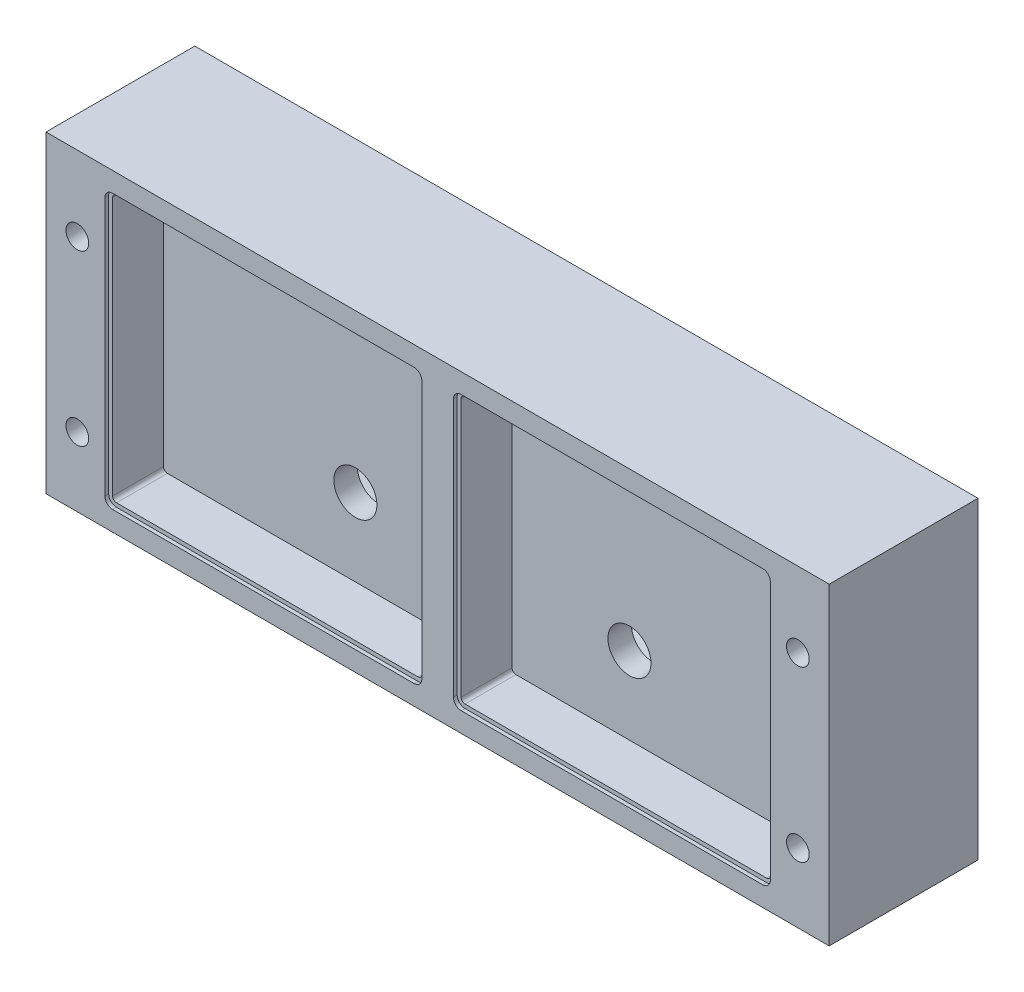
ISO-10303-21;
HEADER;
FILE_DESCRIPTION(('STEP AP214'),'2;1');
FILE_NAME('part.step','',(''),(''),'','','');
FILE_SCHEMA(('AUTOMOTIVE_DESIGN { 1 0 10303 214 1 1 1 1 }'));
ENDSEC;
DATA;
#1=APPLICATION_CONTEXT('core data for automotive mechanical design processes');
#2=APPLICATION_PROTOCOL_DEFINITION('international standard','automotive_design',2000,#1);
#3=PRODUCT_CONTEXT('',#1,'mechanical');
#4=PRODUCT('Part','Part','',(#3));
#5=PRODUCT_RELATED_PRODUCT_CATEGORY('part','',(#4));
#6=PRODUCT_DEFINITION_FORMATION('','',#4);
#7=PRODUCT_DEFINITION_CONTEXT('part definition',#1,'design');
#8=PRODUCT_DEFINITION('design','',#6,#7);
#9=PRODUCT_DEFINITION_SHAPE('','',#8);
#10=(LENGTH_UNIT() NAMED_UNIT(*) SI_UNIT(.MILLI.,.METRE.));
#11=(NAMED_UNIT(*) PLANE_ANGLE_UNIT() SI_UNIT($,.RADIAN.));
#12=(NAMED_UNIT(*) SI_UNIT($,.STERADIAN.) SOLID_ANGLE_UNIT());
#13=UNCERTAINTY_MEASURE_WITH_UNIT(LENGTH_MEASURE(1.E-05),#10,'distance_accuracy_value','');
#14=(GEOMETRIC_REPRESENTATION_CONTEXT(3) GLOBAL_UNCERTAINTY_ASSIGNED_CONTEXT((#13)) GLOBAL_UNIT_ASSIGNED_CONTEXT((#10,
#11,#12)) REPRESENTATION_CONTEXT('',''));
#15=CARTESIAN_POINT('',(0.,0.,0.));
#16=DIRECTION('',(0.,0.,1.));
#17=DIRECTION('',(1.,0.,0.));
#18=AXIS2_PLACEMENT_3D('',#15,#16,#17);
#19=CARTESIAN_POINT('',(-2.45060366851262,25.6704661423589,0.));
#20=DIRECTION('',(0.,0.,-1.));
#21=DIRECTION('',(-1.,0.,0.));
#22=AXIS2_PLACEMENT_3D('',#19,#20,#21);
#23=PLANE('',#22);
#24=CARTESIAN_POINT('',(16.25,44.3050421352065,0.));
#25=DIRECTION('',(0.,0.,-1.));
#26=DIRECTION('',(-1.,0.,0.));
#27=AXIS2_PLACEMENT_3D('',#24,#25,#26);
#28=CIRCLE('',#27,46.8849207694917);
#29=CARTESIAN_POINT('',(-16.9612242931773,11.2110792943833,0.));
#30=VERTEX_POINT('',#29);
#31=CARTESIAN_POINT('',(3.33605222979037,-0.766298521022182,0.));
#32=VERTEX_POINT('',#31);
#33=EDGE_CURVE('E151',#30,#32,#28,.F.);
#34=ORIENTED_EDGE('',*,*,#33,.T.);
#35=DIRECTION('',(0.275439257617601,0.961318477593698,0.));
#36=VECTOR('',#35,1.);
#37=CARTESIAN_POINT('',(3.34567078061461,-0.732728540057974,0.));
#38=LINE('',#37,#36);
#39=CARTESIAN_POINT('',(3.07985007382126,-1.66047703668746,0.));
#40=VERTEX_POINT('',#39);
#41=EDGE_CURVE('E12',#40,#32,#38,.T.);
#42=ORIENTED_EDGE('',*,*,#41,.F.);
#43=CARTESIAN_POINT('',(16.25,44.3050421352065,0.));
#44=DIRECTION('',(0.,0.,-1.));
#45=DIRECTION('',(-1.,0.,0.));
#46=AXIS2_PLACEMENT_3D('',#43,#44,#45);
#47=CIRCLE('',#46,47.8150792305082);
#48=CARTESIAN_POINT('',(-17.6201078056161,10.5545221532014,0.));
#49=VERTEX_POINT('',#48);
#50=EDGE_CURVE('E155',#49,#40,#47,.F.);
#51=ORIENTED_EDGE('',*,*,#50,.F.);
#52=CARTESIAN_POINT('',(-21.1512073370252,7.03589014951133,0.));
#53=DIRECTION('',(0.,0.,-1.));
#54=DIRECTION('',(-1.,0.,0.));
#55=AXIS2_PLACEMENT_3D('',#52,#53,#54);
#56=CIRCLE('',#55,4.98492076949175);
#57=CARTESIAN_POINT('',(-24.6823068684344,3.51725814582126,0.));
#58=VERTEX_POINT('',#57);
#59=EDGE_CURVE('E168',#58,#49,#56,.T.);
#60=ORIENTED_EDGE('',*,*,#59,.F.);
#61=CARTESIAN_POINT('',(16.25,44.3050421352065,0.));
#62=DIRECTION('',(0.,0.,-1.));
#63=DIRECTION('',(-1.,0.,0.));
#64=AXIS2_PLACEMENT_3D('',#61,#62,#63);
#65=CIRCLE('',#64,57.7849207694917);
#66=CARTESIAN_POINT('',(-1.43802134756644,-10.7061473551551,0.));
#67=VERTEX_POINT('',#66);
#68=EDGE_CURVE('E127',#67,#58,#65,.T.);
#69=ORIENTED_EDGE('',*,*,#68,.F.);
#70=DIRECTION('',(0.306100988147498,0.951999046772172,0.));
#71=VECTOR('',#70,1.);
#72=CARTESIAN_POINT('',(-1.42733206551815,-10.6729028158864,0.));
#73=LINE('',#72,#71);
#74=CARTESIAN_POINT('',(-1.72274377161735,-11.5916573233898,0.));
#75=VERTEX_POINT('',#74);
#76=EDGE_CURVE('E142',#75,#67,#73,.T.);
#77=ORIENTED_EDGE('',*,*,#76,.F.);
#78=CARTESIAN_POINT('',(16.25,44.3050421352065,0.));
#79=DIRECTION('',(0.,0.,-1.));
#80=DIRECTION('',(-1.,0.,0.));
#81=AXIS2_PLACEMENT_3D('',#78,#79,#80);
#82=CIRCLE('',#81,58.7150792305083);
#83=CARTESIAN_POINT('',(-25.3411903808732,2.86070100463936,0.));
#84=VERTEX_POINT('',#83);
#85=EDGE_CURVE('E149',#75,#84,#82,.T.);
#86=ORIENTED_EDGE('',*,*,#85,.T.);
#87=CARTESIAN_POINT('',(-21.1512073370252,7.03589014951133,0.));
#88=DIRECTION('',(0.,0.,-1.));
#89=DIRECTION('',(-1.,0.,0.));
#90=AXIS2_PLACEMENT_3D('',#87,#88,#89);
#91=CIRCLE('',#90,5.91507923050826);
#92=EDGE_CURVE('E147',#84,#30,#91,.T.);
#93=ORIENTED_EDGE('',*,*,#92,.T.);
#94=EDGE_LOOP('',(#34,#42,#51,#60,#69,#77,#86,#93));
#95=FACE_BOUND('',#94,.T.);
#96=ADVANCED_FACE('F43',(#95),#23,.T.);
#97=CARTESIAN_POINT('',(-2.45060366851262,25.6704661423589,1.));
#98=DIRECTION('',(0.,0.,-1.));
#99=DIRECTION('',(-1.,0.,0.));
#100=AXIS2_PLACEMENT_3D('',#97,#98,#99);
#101=PLANE('',#100);
#102=DIRECTION('',(0.275439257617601,0.961318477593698,0.));
#103=VECTOR('',#102,1.);
#104=CARTESIAN_POINT('',(3.34567078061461,-0.732728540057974,1.));
#105=LINE('',#104,#103);
#106=CARTESIAN_POINT('',(3.07023152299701,-1.69404701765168,1.));
#107=VERTEX_POINT('',#106);
#108=CARTESIAN_POINT('',(3.34567078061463,-0.732728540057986,1.));
#109=VERTEX_POINT('',#108);
#110=EDGE_CURVE('E83',#107,#109,#105,.T.);
#111=ORIENTED_EDGE('',*,*,#110,.T.);
#112=CARTESIAN_POINT('',(16.25,44.3050421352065,1.));
#113=DIRECTION('',(0.,0.,1.));
#114=DIRECTION('',(-1.,0.,0.));
#115=AXIS2_PLACEMENT_3D('',#112,#113,#114);
#116=CIRCLE('',#115,46.85);
#117=CARTESIAN_POINT('',(-16.9364879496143,11.2357282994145,1.));
#118=VERTEX_POINT('',#117);
#119=EDGE_CURVE('E156',#118,#109,#116,.T.);
#120=ORIENTED_EDGE('',*,*,#119,.F.);
#121=CARTESIAN_POINT('',(-21.1512073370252,7.03589014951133,1.));
#122=DIRECTION('',(0.,0.,-1.));
#123=DIRECTION('',(-1.,0.,0.));
#124=AXIS2_PLACEMENT_3D('',#121,#122,#123);
#125=CIRCLE('',#124,5.95);
#126=CARTESIAN_POINT('',(-25.3659267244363,2.83605199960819,1.));
#127=VERTEX_POINT('',#126);
#128=EDGE_CURVE('E130',#127,#118,#125,.T.);
#129=ORIENTED_EDGE('',*,*,#128,.F.);
#130=CARTESIAN_POINT('',(16.25,44.3050421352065,1.));
#131=DIRECTION('',(0.,0.,-1.));
#132=DIRECTION('',(-1.,0.,0.));
#133=AXIS2_PLACEMENT_3D('',#130,#131,#132);
#134=CIRCLE('',#133,58.75);
#135=CARTESIAN_POINT('',(-1.73343305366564,-11.6249018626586,1.));
#136=VERTEX_POINT('',#135);
#137=EDGE_CURVE('E109',#136,#127,#134,.T.);
#138=ORIENTED_EDGE('',*,*,#137,.F.);
#139=DIRECTION('',(0.306100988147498,0.951999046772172,0.));
#140=VECTOR('',#139,1.);
#141=CARTESIAN_POINT('',(-1.42733206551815,-10.6729028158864,1.));
#142=LINE('',#141,#140);
#143=CARTESIAN_POINT('',(-1.42733206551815,-10.6729028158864,1.));
#144=VERTEX_POINT('',#143);
#145=EDGE_CURVE('E78',#136,#144,#142,.T.);
#146=ORIENTED_EDGE('',*,*,#145,.T.);
#147=CARTESIAN_POINT('',(16.25,44.3050421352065,1.));
#148=DIRECTION('',(0.,0.,-1.));
#149=DIRECTION('',(-1.,0.,0.));
#150=AXIS2_PLACEMENT_3D('',#147,#148,#149);
#151=CIRCLE('',#150,57.75);
#152=CARTESIAN_POINT('',(-24.6575705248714,3.54190715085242,1.));
#153=VERTEX_POINT('',#152);
#154=EDGE_CURVE('E115',#144,#153,#151,.T.);
#155=ORIENTED_EDGE('',*,*,#154,.T.);
#156=CARTESIAN_POINT('',(-21.1512073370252,7.03589014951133,1.));
#157=DIRECTION('',(0.,0.,-1.));
#158=DIRECTION('',(-1.,0.,0.));
#159=AXIS2_PLACEMENT_3D('',#156,#157,#158);
#160=CIRCLE('',#159,4.95);
#161=CARTESIAN_POINT('',(-17.6448441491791,10.5298731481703,1.));
#162=VERTEX_POINT('',#161);
#163=EDGE_CURVE('E120',#153,#162,#160,.T.);
#164=ORIENTED_EDGE('',*,*,#163,.T.);
#165=CARTESIAN_POINT('',(16.25,44.3050421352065,1.));
#166=DIRECTION('',(0.,0.,1.));
#167=DIRECTION('',(-1.,0.,0.));
#168=AXIS2_PLACEMENT_3D('',#165,#166,#167);
#169=CIRCLE('',#168,47.85);
#170=EDGE_CURVE('E46',#162,#107,#169,.T.);
#171=ORIENTED_EDGE('',*,*,#170,.T.);
#172=EDGE_LOOP('',(#111,#120,#129,#138,#146,#155,#164,#171));
#173=FACE_BOUND('',#172,.T.);
#174=ADVANCED_FACE('F117',(#173),#101,.F.);
#175=CARTESIAN_POINT('',(16.25,44.3050421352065,1.));
#176=DIRECTION('',(0.,0.,-1.));
#177=DIRECTION('',(-1.,0.,0.));
#178=AXIS2_PLACEMENT_3D('',#175,#176,#177);
#179=CONICAL_SURFACE('',#178,46.85,0.0349065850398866);
#180=DIRECTION('',(-0.0096126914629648,-0.0335495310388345,-0.999390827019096));
#181=VECTOR('',#180,1.);
#182=CARTESIAN_POINT('',(16.2499999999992,44.3050421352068,1342.60846630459));
#183=LINE('',#182,#181);
#184=EDGE_CURVE('E52',#32,#109,#183,.F.);
#185=ORIENTED_EDGE('',*,*,#184,.F.);
#186=ORIENTED_EDGE('',*,*,#33,.F.);
#187=DIRECTION('',(0.0247212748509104,0.0246339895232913,0.999390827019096));
#188=VECTOR('',#187,1.);
#189=CARTESIAN_POINT('',(-16.9364879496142,11.2357282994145,1.));
#190=LINE('',#189,#188);
#191=EDGE_CURVE('E137',#30,#118,#190,.T.);
#192=ORIENTED_EDGE('',*,*,#191,.T.);
#193=ORIENTED_EDGE('',*,*,#119,.T.);
#194=EDGE_LOOP('',(#185,#186,#192,#193));
#195=FACE_BOUND('',#194,.T.);
#196=ADVANCED_FACE('F178',(#195),#179,.F.);
#197=CARTESIAN_POINT('',(16.25,44.3050421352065,1.));
#198=DIRECTION('',(0.,0.,1.));
#199=DIRECTION('',(-1.,0.,0.));
#200=AXIS2_PLACEMENT_3D('',#197,#198,#199);
#201=CONICAL_SURFACE('',#200,58.75,0.0349065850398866);
#202=DIRECTION('',(0.0106827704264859,0.0332242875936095,-0.999390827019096));
#203=VECTOR('',#202,1.);
#204=CARTESIAN_POINT('',(16.2499999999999,44.3050421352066,-1681.37988037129));
#205=LINE('',#204,#203);
#206=EDGE_CURVE('E143',#136,#75,#205,.T.);
#207=ORIENTED_EDGE('',*,*,#206,.F.);
#208=ORIENTED_EDGE('',*,*,#137,.T.);
#209=DIRECTION('',(-0.0247212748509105,-0.0246339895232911,0.999390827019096));
#210=VECTOR('',#209,1.);
#211=CARTESIAN_POINT('',(-25.3659267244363,2.8360519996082,1.));
#212=LINE('',#211,#210);
#213=EDGE_CURVE('E169',#84,#127,#212,.T.);
#214=ORIENTED_EDGE('',*,*,#213,.F.);
#215=ORIENTED_EDGE('',*,*,#85,.F.);
#216=EDGE_LOOP('',(#207,#208,#214,#215));
#217=FACE_BOUND('',#216,.T.);
#218=ADVANCED_FACE('F187',(#217),#201,.T.);
#219=CARTESIAN_POINT('',(16.25,44.3050421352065,1.));
#220=DIRECTION('',(0.,0.,1.));
#221=DIRECTION('',(-1.,0.,0.));
#222=AXIS2_PLACEMENT_3D('',#219,#220,#221);
#223=CONICAL_SURFACE('',#222,47.85,0.0349065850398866);
#224=ORIENTED_EDGE('',*,*,#50,.T.);
#225=DIRECTION('',(0.0096126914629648,0.0335495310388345,-0.999390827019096));
#226=VECTOR('',#225,1.);
#227=CARTESIAN_POINT('',(16.2499999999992,44.3050421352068,-1369.24471958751));
#228=LINE('',#227,#226);
#229=EDGE_CURVE('E162',#40,#107,#228,.F.);
#230=ORIENTED_EDGE('',*,*,#229,.T.);
#231=ORIENTED_EDGE('',*,*,#170,.F.);
#232=DIRECTION('',(-0.0247212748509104,-0.0246339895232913,0.999390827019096));
#233=VECTOR('',#232,1.);
#234=CARTESIAN_POINT('',(-17.6448441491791,10.5298731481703,1.));
#235=LINE('',#234,#233);
#236=EDGE_CURVE('E135',#49,#162,#235,.T.);
#237=ORIENTED_EDGE('',*,*,#236,.F.);
#238=EDGE_LOOP('',(#224,#230,#231,#237));
#239=FACE_BOUND('',#238,.T.);
#240=ADVANCED_FACE('F182',(#239),#223,.T.);
#241=CARTESIAN_POINT('',(16.25,44.3050421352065,1.));
#242=DIRECTION('',(0.,0.,-1.));
#243=DIRECTION('',(-1.,0.,0.));
#244=AXIS2_PLACEMENT_3D('',#241,#242,#243);
#245=CONICAL_SURFACE('',#244,57.75,0.0349065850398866);
#246=ORIENTED_EDGE('',*,*,#154,.F.);
#247=DIRECTION('',(-0.0106827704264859,-0.0332242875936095,-0.999390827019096));
#248=VECTOR('',#247,1.);
#249=CARTESIAN_POINT('',(16.2499999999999,44.3050421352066,1654.74362708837));
#250=LINE('',#249,#248);
#251=EDGE_CURVE('E160',#144,#67,#250,.T.);
#252=ORIENTED_EDGE('',*,*,#251,.T.);
#253=ORIENTED_EDGE('',*,*,#68,.T.);
#254=DIRECTION('',(0.0247212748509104,0.0246339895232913,0.999390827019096));
#255=VECTOR('',#254,1.);
#256=CARTESIAN_POINT('',(-24.6575705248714,3.54190715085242,1.));
#257=LINE('',#256,#255);
#258=EDGE_CURVE('E124',#58,#153,#257,.T.);
#259=ORIENTED_EDGE('',*,*,#258,.T.);
#260=EDGE_LOOP('',(#246,#252,#253,#259));
#261=FACE_BOUND('',#260,.T.);
#262=ADVANCED_FACE('F125',(#261),#245,.F.);
#263=CARTESIAN_POINT('',(-21.1512073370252,7.03589014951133,1.));
#264=DIRECTION('',(0.,0.,1.));
#265=DIRECTION('',(-1.,0.,0.));
#266=AXIS2_PLACEMENT_3D('',#263,#264,#265);
#267=CONICAL_SURFACE('',#266,5.95,0.0349065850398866);
#268=ORIENTED_EDGE('',*,*,#128,.T.);
#269=ORIENTED_EDGE('',*,*,#191,.F.);
#270=ORIENTED_EDGE('',*,*,#92,.F.);
#271=ORIENTED_EDGE('',*,*,#213,.T.);
#272=EDGE_LOOP('',(#268,#269,#270,#271));
#273=FACE_BOUND('',#272,.T.);
#274=ADVANCED_FACE('F186',(#273),#267,.T.);
#275=CARTESIAN_POINT('',(-21.1512073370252,7.03589014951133,1.));
#276=DIRECTION('',(0.,0.,-1.));
#277=DIRECTION('',(-1.,0.,0.));
#278=AXIS2_PLACEMENT_3D('',#275,#276,#277);
#279=CONICAL_SURFACE('',#278,4.95,0.0349065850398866);
#280=ORIENTED_EDGE('',*,*,#163,.F.);
#281=ORIENTED_EDGE('',*,*,#258,.F.);
#282=ORIENTED_EDGE('',*,*,#59,.T.);
#283=ORIENTED_EDGE('',*,*,#236,.T.);
#284=EDGE_LOOP('',(#280,#281,#282,#283));
#285=FACE_BOUND('',#284,.T.);
#286=ADVANCED_FACE('F133',(#285),#279,.F.);
#287=CARTESIAN_POINT('',(-1.42733206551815,-10.6729028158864,0.));
#288=DIRECTION('',(0.951999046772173,-0.306100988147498,0.));
#289=DIRECTION('',(0.306100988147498,0.951999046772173,0.));
#290=AXIS2_PLACEMENT_3D('',#287,#288,#289);
#291=PLANE('',#290);
#292=ORIENTED_EDGE('',*,*,#206,.T.);
#293=ORIENTED_EDGE('',*,*,#76,.T.);
#294=ORIENTED_EDGE('',*,*,#251,.F.);
#295=ORIENTED_EDGE('',*,*,#145,.F.);
#296=EDGE_LOOP('',(#292,#293,#294,#295));
#297=FACE_BOUND('',#296,.T.);
#298=ADVANCED_FACE('F188',(#297),#291,.T.);
#299=CARTESIAN_POINT('',(3.34567078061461,-0.732728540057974,0.));
#300=DIRECTION('',(0.961318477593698,-0.275439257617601,0.));
#301=DIRECTION('',(0.275439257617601,0.961318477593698,0.));
#302=AXIS2_PLACEMENT_3D('',#299,#300,#301);
#303=PLANE('',#302);
#304=ORIENTED_EDGE('',*,*,#184,.T.);
#305=ORIENTED_EDGE('',*,*,#110,.F.);
#306=ORIENTED_EDGE('',*,*,#229,.F.);
#307=ORIENTED_EDGE('',*,*,#41,.T.);
#308=EDGE_LOOP('',(#304,#305,#306,#307));
#309=FACE_BOUND('',#308,.T.);
#310=ADVANCED_FACE('F190',(#309),#303,.T.);
#311=CLOSED_SHELL('',(#96,#174,#196,#218,#240,#262,#274,#286,#298,#310));
#312=MANIFOLD_SOLID_BREP('B2',#311);
#313=CARTESIAN_POINT('',(53.6512073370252,7.03589014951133,1.));
#314=DIRECTION('',(0.,0.,1.));
#315=DIRECTION('',(-1.,0.,0.));
#316=AXIS2_PLACEMENT_3D('',#313,#314,#315);
#317=CONICAL_SURFACE('',#316,5.94999999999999,0.0349065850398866);
#318=CARTESIAN_POINT('',(53.6512073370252,7.03589014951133,1.));
#319=DIRECTION('',(0.,0.,-1.));
#320=DIRECTION('',(-1.,0.,0.));
#321=AXIS2_PLACEMENT_3D('',#318,#319,#320);
#322=CIRCLE('',#321,5.94999999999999);
#323=CARTESIAN_POINT('',(49.4364879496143,11.2357282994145,1.));
#324=VERTEX_POINT('',#323);
#325=CARTESIAN_POINT('',(57.8659267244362,2.8360519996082,1.));
#326=VERTEX_POINT('',#325);
#327=EDGE_CURVE('E362',#324,#326,#322,.T.);
#328=ORIENTED_EDGE('',*,*,#327,.T.);
#329=DIRECTION('',(0.0247212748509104,-0.0246339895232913,0.999390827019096));
#330=VECTOR('',#329,1.);
#331=CARTESIAN_POINT('',(57.8659267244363,2.8360519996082,1.));
#332=LINE('',#331,#330);
#333=CARTESIAN_POINT('',(57.8411903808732,2.86070100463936,0.));
#334=VERTEX_POINT('',#333);
#335=EDGE_CURVE('E379',#334,#326,#332,.T.);
#336=ORIENTED_EDGE('',*,*,#335,.F.);
#337=CARTESIAN_POINT('',(53.6512073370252,7.03589014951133,0.));
#338=DIRECTION('',(0.,0.,-1.));
#339=DIRECTION('',(-1.,0.,0.));
#340=AXIS2_PLACEMENT_3D('',#337,#338,#339);
#341=CIRCLE('',#340,5.91507923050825);
#342=CARTESIAN_POINT('',(49.4612242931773,11.2110792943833,0.));
#343=VERTEX_POINT('',#342);
#344=EDGE_CURVE('E384',#343,#334,#341,.T.);
#345=ORIENTED_EDGE('',*,*,#344,.F.);
#346=DIRECTION('',(-0.0247212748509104,0.0246339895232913,0.999390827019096));
#347=VECTOR('',#346,1.);
#348=CARTESIAN_POINT('',(49.4364879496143,11.2357282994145,1.));
#349=LINE('',#348,#347);
#350=EDGE_CURVE('E377',#343,#324,#349,.T.);
#351=ORIENTED_EDGE('',*,*,#350,.T.);
#352=EDGE_LOOP('',(#328,#336,#345,#351));
#353=FACE_BOUND('',#352,.T.);
#354=ADVANCED_FACE('F279',(#353),#317,.T.);
#355=CARTESIAN_POINT('',(53.6512073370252,7.03589014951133,1.));
#356=DIRECTION('',(0.,0.,-1.));
#357=DIRECTION('',(-1.,0.,0.));
#358=AXIS2_PLACEMENT_3D('',#355,#356,#357);
#359=CONICAL_SURFACE('',#358,4.94999999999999,0.0349065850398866);
#360=CARTESIAN_POINT('',(53.6512073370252,7.03589014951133,1.));
#361=DIRECTION('',(0.,0.,-1.));
#362=DIRECTION('',(-1.,0.,0.));
#363=AXIS2_PLACEMENT_3D('',#360,#361,#362);
#364=CIRCLE('',#363,4.94999999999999);
#365=CARTESIAN_POINT('',(50.1448441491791,10.5298731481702,1.));
#366=VERTEX_POINT('',#365);
#367=CARTESIAN_POINT('',(57.1575705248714,3.54190715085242,1.));
#368=VERTEX_POINT('',#367);
#369=EDGE_CURVE('E403',#366,#368,#364,.T.);
#370=ORIENTED_EDGE('',*,*,#369,.F.);
#371=DIRECTION('',(0.0247212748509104,-0.0246339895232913,0.999390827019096));
#372=VECTOR('',#371,1.);
#373=CARTESIAN_POINT('',(50.1448441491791,10.5298731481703,1.));
#374=LINE('',#373,#372);
#375=CARTESIAN_POINT('',(50.1201078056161,10.5545221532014,0.));
#376=VERTEX_POINT('',#375);
#377=EDGE_CURVE('E364',#376,#366,#374,.T.);
#378=ORIENTED_EDGE('',*,*,#377,.F.);
#379=CARTESIAN_POINT('',(53.6512073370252,7.03589014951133,0.));
#380=DIRECTION('',(0.,0.,-1.));
#381=DIRECTION('',(-1.,0.,0.));
#382=AXIS2_PLACEMENT_3D('',#379,#380,#381);
#383=CIRCLE('',#382,4.98492076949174);
#384=CARTESIAN_POINT('',(57.1823068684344,3.51725814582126,0.));
#385=VERTEX_POINT('',#384);
#386=EDGE_CURVE('E392',#376,#385,#383,.T.);
#387=ORIENTED_EDGE('',*,*,#386,.T.);
#388=DIRECTION('',(-0.0247212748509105,0.0246339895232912,0.999390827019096));
#389=VECTOR('',#388,1.);
#390=CARTESIAN_POINT('',(57.1575705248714,3.54190715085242,1.));
#391=LINE('',#390,#389);
#392=EDGE_CURVE('E369',#385,#368,#391,.T.);
#393=ORIENTED_EDGE('',*,*,#392,.T.);
#394=EDGE_LOOP('',(#370,#378,#387,#393));
#395=FACE_BOUND('',#394,.T.);
#396=ADVANCED_FACE('F421',(#395),#359,.F.);
#397=CARTESIAN_POINT('',(16.25,44.3050421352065,1.));
#398=DIRECTION('',(0.,0.,-1.));
#399=DIRECTION('',(-1.,0.,0.));
#400=AXIS2_PLACEMENT_3D('',#397,#398,#399);
#401=CONICAL_SURFACE('',#400,46.85,0.0349065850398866);
#402=DIRECTION('',(-0.00961269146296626,0.0335495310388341,0.999390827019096));
#403=VECTOR('',#402,1.);
#404=CARTESIAN_POINT('',(16.2499999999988,44.3050421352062,1342.60846630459));
#405=LINE('',#404,#403);
#406=CARTESIAN_POINT('',(29.1543292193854,-0.732728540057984,1.));
#407=VERTEX_POINT('',#406);
#408=CARTESIAN_POINT('',(29.1639477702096,-0.766298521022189,0.));
#409=VERTEX_POINT('',#408);
#410=EDGE_CURVE('E344',#407,#409,#405,.F.);
#411=ORIENTED_EDGE('',*,*,#410,.F.);
#412=CARTESIAN_POINT('',(16.25,44.3050421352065,1.));
#413=DIRECTION('',(0.,0.,1.));
#414=DIRECTION('',(-1.,0.,0.));
#415=AXIS2_PLACEMENT_3D('',#412,#413,#414);
#416=CIRCLE('',#415,46.85);
#417=EDGE_CURVE('E354',#407,#324,#416,.T.);
#418=ORIENTED_EDGE('',*,*,#417,.T.);
#419=ORIENTED_EDGE('',*,*,#350,.F.);
#420=CARTESIAN_POINT('',(16.25,44.3050421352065,0.));
#421=DIRECTION('',(0.,0.,-1.));
#422=DIRECTION('',(-1.,0.,0.));
#423=AXIS2_PLACEMENT_3D('',#420,#421,#422);
#424=CIRCLE('',#423,46.8849207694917);
#425=EDGE_CURVE('E356',#409,#343,#424,.F.);
#426=ORIENTED_EDGE('',*,*,#425,.F.);
#427=EDGE_LOOP('',(#411,#418,#419,#426));
#428=FACE_BOUND('',#427,.T.);
#429=ADVANCED_FACE('F352',(#428),#401,.F.);
#430=CARTESIAN_POINT('',(16.25,44.3050421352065,1.));
#431=DIRECTION('',(0.,0.,1.));
#432=DIRECTION('',(-1.,0.,0.));
#433=AXIS2_PLACEMENT_3D('',#430,#431,#432);
#434=CONICAL_SURFACE('',#433,58.75,0.0349065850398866);
#435=DIRECTION('',(0.0106827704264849,-0.0332242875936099,0.999390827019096));
#436=VECTOR('',#435,1.);
#437=CARTESIAN_POINT('',(16.2500000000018,44.3050421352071,-1681.37988037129));
#438=LINE('',#437,#436);
#439=CARTESIAN_POINT('',(34.2227437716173,-11.5916573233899,0.));
#440=VERTEX_POINT('',#439);
#441=CARTESIAN_POINT('',(34.2334330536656,-11.6249018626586,1.));
#442=VERTEX_POINT('',#441);
#443=EDGE_CURVE('E358',#440,#442,#438,.T.);
#444=ORIENTED_EDGE('',*,*,#443,.F.);
#445=CARTESIAN_POINT('',(16.25,44.3050421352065,0.));
#446=DIRECTION('',(0.,0.,-1.));
#447=DIRECTION('',(-1.,0.,0.));
#448=AXIS2_PLACEMENT_3D('',#445,#446,#447);
#449=CIRCLE('',#448,58.7150792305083);
#450=EDGE_CURVE('E382',#334,#440,#449,.T.);
#451=ORIENTED_EDGE('',*,*,#450,.F.);
#452=ORIENTED_EDGE('',*,*,#335,.T.);
#453=CARTESIAN_POINT('',(16.25,44.3050421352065,1.));
#454=DIRECTION('',(0.,0.,-1.));
#455=DIRECTION('',(-1.,0.,0.));
#456=AXIS2_PLACEMENT_3D('',#453,#454,#455);
#457=CIRCLE('',#456,58.75);
#458=EDGE_CURVE('E366',#326,#442,#457,.T.);
#459=ORIENTED_EDGE('',*,*,#458,.T.);
#460=EDGE_LOOP('',(#444,#451,#452,#459));
#461=FACE_BOUND('',#460,.T.);
#462=ADVANCED_FACE('F414',(#461),#434,.T.);
#463=CARTESIAN_POINT('',(16.25,44.3050421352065,1.));
#464=DIRECTION('',(0.,0.,-1.));
#465=DIRECTION('',(-1.,0.,0.));
#466=AXIS2_PLACEMENT_3D('',#463,#464,#465);
#467=CONICAL_SURFACE('',#466,57.75,0.0349065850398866);
#468=CARTESIAN_POINT('',(16.25,44.3050421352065,0.));
#469=DIRECTION('',(0.,0.,-1.));
#470=DIRECTION('',(-1.,0.,0.));
#471=AXIS2_PLACEMENT_3D('',#468,#469,#470);
#472=CIRCLE('',#471,57.7849207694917);
#473=CARTESIAN_POINT('',(33.9380213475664,-10.7061473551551,0.));
#474=VERTEX_POINT('',#473);
#475=EDGE_CURVE('E389',#385,#474,#472,.T.);
#476=ORIENTED_EDGE('',*,*,#475,.T.);
#477=DIRECTION('',(-0.0106827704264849,0.0332242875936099,0.999390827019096));
#478=VECTOR('',#477,1.);
#479=CARTESIAN_POINT('',(16.2500000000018,44.3050421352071,1654.74362708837));
#480=LINE('',#479,#478);
#481=CARTESIAN_POINT('',(33.9273320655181,-10.6729028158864,1.));
#482=VERTEX_POINT('',#481);
#483=EDGE_CURVE('E287',#474,#482,#480,.T.);
#484=ORIENTED_EDGE('',*,*,#483,.T.);
#485=CARTESIAN_POINT('',(16.25,44.3050421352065,1.));
#486=DIRECTION('',(0.,0.,-1.));
#487=DIRECTION('',(-1.,0.,0.));
#488=AXIS2_PLACEMENT_3D('',#485,#486,#487);
#489=CIRCLE('',#488,57.75);
#490=EDGE_CURVE('E372',#368,#482,#489,.T.);
#491=ORIENTED_EDGE('',*,*,#490,.F.);
#492=ORIENTED_EDGE('',*,*,#392,.F.);
#493=EDGE_LOOP('',(#476,#484,#491,#492));
#494=FACE_BOUND('',#493,.T.);
#495=ADVANCED_FACE('F281',(#494),#467,.F.);
#496=CARTESIAN_POINT('',(16.25,44.3050421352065,1.));
#497=DIRECTION('',(0.,0.,1.));
#498=DIRECTION('',(-1.,0.,0.));
#499=AXIS2_PLACEMENT_3D('',#496,#497,#498);
#500=CONICAL_SURFACE('',#499,47.85,0.0349065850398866);
#501=CARTESIAN_POINT('',(16.25,44.3050421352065,1.));
#502=DIRECTION('',(0.,0.,1.));
#503=DIRECTION('',(-1.,0.,0.));
#504=AXIS2_PLACEMENT_3D('',#501,#502,#503);
#505=CIRCLE('',#504,47.85);
#506=CARTESIAN_POINT('',(29.429768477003,-1.69404701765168,1.));
#507=VERTEX_POINT('',#506);
#508=EDGE_CURVE('E357',#507,#366,#505,.T.);
#509=ORIENTED_EDGE('',*,*,#508,.F.);
#510=DIRECTION('',(0.00961269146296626,-0.0335495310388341,0.999390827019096));
#511=VECTOR('',#510,1.);
#512=CARTESIAN_POINT('',(16.2499999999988,44.3050421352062,-1369.24471958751));
#513=LINE('',#512,#511);
#514=CARTESIAN_POINT('',(29.4201499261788,-1.66047703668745,0.));
#515=VERTEX_POINT('',#514);
#516=EDGE_CURVE('E41',#507,#515,#513,.F.);
#517=ORIENTED_EDGE('',*,*,#516,.T.);
#518=CARTESIAN_POINT('',(16.25,44.3050421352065,0.));
#519=DIRECTION('',(0.,0.,-1.));
#520=DIRECTION('',(-1.,0.,0.));
#521=AXIS2_PLACEMENT_3D('',#518,#519,#520);
#522=CIRCLE('',#521,47.8150792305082);
#523=EDGE_CURVE('E390',#515,#376,#522,.F.);
#524=ORIENTED_EDGE('',*,*,#523,.T.);
#525=ORIENTED_EDGE('',*,*,#377,.T.);
#526=EDGE_LOOP('',(#509,#517,#524,#525));
#527=FACE_BOUND('',#526,.T.);
#528=ADVANCED_FACE('F430',(#527),#500,.T.);
#529=CARTESIAN_POINT('',(-2.45060366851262,25.6704661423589,1.));
#530=DIRECTION('',(0.,0.,-1.));
#531=DIRECTION('',(-1.,0.,0.));
#532=AXIS2_PLACEMENT_3D('',#529,#530,#531);
#533=PLANE('',#532);
#534=DIRECTION('',(0.275439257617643,-0.961318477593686,0.));
#535=VECTOR('',#534,1.);
#536=CARTESIAN_POINT('',(29.1543292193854,-0.732728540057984,1.));
#537=LINE('',#536,#535);
#538=EDGE_CURVE('E341',#407,#507,#537,.T.);
#539=ORIENTED_EDGE('',*,*,#538,.T.);
#540=ORIENTED_EDGE('',*,*,#508,.T.);
#541=ORIENTED_EDGE('',*,*,#369,.T.);
#542=ORIENTED_EDGE('',*,*,#490,.T.);
#543=DIRECTION('',(0.306100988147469,-0.951999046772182,0.));
#544=VECTOR('',#543,1.);
#545=CARTESIAN_POINT('',(33.9273320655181,-10.6729028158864,1.));
#546=LINE('',#545,#544);
#547=EDGE_CURVE('E301',#482,#442,#546,.T.);
#548=ORIENTED_EDGE('',*,*,#547,.T.);
#549=ORIENTED_EDGE('',*,*,#458,.F.);
#550=ORIENTED_EDGE('',*,*,#327,.F.);
#551=ORIENTED_EDGE('',*,*,#417,.F.);
#552=EDGE_LOOP('',(#539,#540,#541,#542,#548,#549,#550,#551));
#553=FACE_BOUND('',#552,.T.);
#554=ADVANCED_FACE('F360',(#553),#533,.F.);
#555=CARTESIAN_POINT('',(-2.45060366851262,25.6704661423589,0.));
#556=DIRECTION('',(0.,0.,-1.));
#557=DIRECTION('',(-1.,0.,0.));
#558=AXIS2_PLACEMENT_3D('',#555,#556,#557);
#559=PLANE('',#558);
#560=ORIENTED_EDGE('',*,*,#523,.F.);
#561=DIRECTION('',(0.275439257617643,-0.961318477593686,0.));
#562=VECTOR('',#561,1.);
#563=CARTESIAN_POINT('',(29.1543292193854,-0.732728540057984,0.));
#564=LINE('',#563,#562);
#565=EDGE_CURVE('E294',#409,#515,#564,.T.);
#566=ORIENTED_EDGE('',*,*,#565,.F.);
#567=ORIENTED_EDGE('',*,*,#425,.T.);
#568=ORIENTED_EDGE('',*,*,#344,.T.);
#569=ORIENTED_EDGE('',*,*,#450,.T.);
#570=DIRECTION('',(0.306100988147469,-0.951999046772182,0.));
#571=VECTOR('',#570,1.);
#572=CARTESIAN_POINT('',(33.9273320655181,-10.6729028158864,0.));
#573=LINE('',#572,#571);
#574=EDGE_CURVE('E348',#474,#440,#573,.T.);
#575=ORIENTED_EDGE('',*,*,#574,.F.);
#576=ORIENTED_EDGE('',*,*,#475,.F.);
#577=ORIENTED_EDGE('',*,*,#386,.F.);
#578=EDGE_LOOP('',(#560,#566,#567,#568,#569,#575,#576,#577));
#579=FACE_BOUND('',#578,.T.);
#580=ADVANCED_FACE('F416',(#579),#559,.T.);
#581=CARTESIAN_POINT('',(33.9273320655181,-10.6729028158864,0.));
#582=DIRECTION('',(-0.951999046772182,-0.306100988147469,0.));
#583=DIRECTION('',(0.306100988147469,-0.951999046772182,0.));
#584=AXIS2_PLACEMENT_3D('',#581,#582,#583);
#585=PLANE('',#584);
#586=ORIENTED_EDGE('',*,*,#443,.T.);
#587=ORIENTED_EDGE('',*,*,#547,.F.);
#588=ORIENTED_EDGE('',*,*,#483,.F.);
#589=ORIENTED_EDGE('',*,*,#574,.T.);
#590=EDGE_LOOP('',(#586,#587,#588,#589));
#591=FACE_BOUND('',#590,.T.);
#592=ADVANCED_FACE('F410',(#591),#585,.T.);
#593=CARTESIAN_POINT('',(29.1543292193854,-0.732728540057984,0.));
#594=DIRECTION('',(-0.961318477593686,-0.275439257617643,0.));
#595=DIRECTION('',(0.275439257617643,-0.961318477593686,0.));
#596=AXIS2_PLACEMENT_3D('',#593,#594,#595);
#597=PLANE('',#596);
#598=ORIENTED_EDGE('',*,*,#410,.T.);
#599=ORIENTED_EDGE('',*,*,#565,.T.);
#600=ORIENTED_EDGE('',*,*,#516,.F.);
#601=ORIENTED_EDGE('',*,*,#538,.F.);
#602=EDGE_LOOP('',(#598,#599,#600,#601));
#603=FACE_BOUND('',#602,.T.);
#604=ADVANCED_FACE('F343',(#603),#597,.T.);
#605=CLOSED_SHELL('',(#354,#396,#429,#462,#495,#528,#554,#580,#592,#604));
#606=MANIFOLD_SOLID_BREP('B6',#605);
#607=CARTESIAN_POINT('',(66.25,-18.4375,19.));
#608=DIRECTION('',(0.,0.,-1.));
#609=DIRECTION('',(-1.,0.,0.));
#610=AXIS2_PLACEMENT_3D('',#607,#608,#609);
#611=PLANE('',#610);
#612=CARTESIAN_POINT('',(13.25,-14.9375,19.));
#613=DIRECTION('',(0.,0.,1.));
#614=DIRECTION('',(1.,0.,0.));
#615=AXIS2_PLACEMENT_3D('',#612,#613,#614);
#616=CIRCLE('',#615,0.982539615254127);
#617=CARTESIAN_POINT('',(13.25,-15.9200396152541,19.));
#618=VERTEX_POINT('',#617);
#619=CARTESIAN_POINT('',(14.2325396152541,-14.9375,19.));
#620=VERTEX_POINT('',#619);
#621=EDGE_CURVE('E891',#618,#620,#616,.T.);
#622=ORIENTED_EDGE('',*,*,#621,.F.);
#623=DIRECTION('',(-1.,0.,0.));
#624=VECTOR('',#623,1.);
#625=CARTESIAN_POINT('',(-25.25,-15.9200396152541,19.));
#626=LINE('',#625,#624);
#627=CARTESIAN_POINT('',(-25.25,-15.9200396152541,19.));
#628=VERTEX_POINT('',#627);
#629=EDGE_CURVE('E901',#628,#618,#626,.F.);
#630=ORIENTED_EDGE('',*,*,#629,.F.);
#631=CARTESIAN_POINT('',(-25.25,-14.9375,19.));
#632=DIRECTION('',(0.,0.,1.));
#633=DIRECTION('',(1.,0.,0.));
#634=AXIS2_PLACEMENT_3D('',#631,#632,#633);
#635=CIRCLE('',#634,0.982539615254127);
#636=CARTESIAN_POINT('',(-26.2325396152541,-14.9375,19.));
#637=VERTEX_POINT('',#636);
#638=EDGE_CURVE('E929',#637,#628,#635,.T.);
#639=ORIENTED_EDGE('',*,*,#638,.F.);
#640=DIRECTION('',(0.,1.,0.));
#641=VECTOR('',#640,1.);
#642=CARTESIAN_POINT('',(-26.2325396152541,18.0625,19.));
#643=LINE('',#642,#641);
#644=CARTESIAN_POINT('',(-26.2325396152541,18.0625,19.));
#645=VERTEX_POINT('',#644);
#646=EDGE_CURVE('E927',#645,#637,#643,.F.);
#647=ORIENTED_EDGE('',*,*,#646,.F.);
#648=CARTESIAN_POINT('',(-25.25,18.0625,19.));
#649=DIRECTION('',(0.,0.,1.));
#650=DIRECTION('',(1.,0.,0.));
#651=AXIS2_PLACEMENT_3D('',#648,#649,#650);
#652=CIRCLE('',#651,0.982539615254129);
#653=CARTESIAN_POINT('',(-25.25,19.0450396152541,19.));
#654=VERTEX_POINT('',#653);
#655=EDGE_CURVE('E925',#654,#645,#652,.T.);
#656=ORIENTED_EDGE('',*,*,#655,.F.);
#657=DIRECTION('',(1.,0.,0.));
#658=VECTOR('',#657,1.);
#659=CARTESIAN_POINT('',(13.25,19.0450396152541,19.));
#660=LINE('',#659,#658);
#661=CARTESIAN_POINT('',(13.25,19.0450396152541,19.));
#662=VERTEX_POINT('',#661);
#663=EDGE_CURVE('E923',#662,#654,#660,.F.);
#664=ORIENTED_EDGE('',*,*,#663,.F.);
#665=CARTESIAN_POINT('',(13.25,18.0625,19.));
#666=DIRECTION('',(0.,0.,1.));
#667=DIRECTION('',(1.,0.,0.));
#668=AXIS2_PLACEMENT_3D('',#665,#666,#667);
#669=CIRCLE('',#668,0.982539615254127);
#670=CARTESIAN_POINT('',(14.2325396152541,18.0625,19.));
#671=VERTEX_POINT('',#670);
#672=EDGE_CURVE('E921',#671,#662,#669,.T.);
#673=ORIENTED_EDGE('',*,*,#672,.F.);
#674=DIRECTION('',(0.,-1.,0.));
#675=VECTOR('',#674,1.);
#676=CARTESIAN_POINT('',(14.2325396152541,-14.9375,19.));
#677=LINE('',#676,#675);
#678=EDGE_CURVE('E919',#620,#671,#677,.F.);
#679=ORIENTED_EDGE('',*,*,#678,.F.);
#680=EDGE_LOOP('',(#622,#630,#639,#647,#656,#664,#673,#679));
#681=FACE_BOUND('',#680,.T.);
#682=CARTESIAN_POINT('',(-29.75,-9.61656175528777,19.));
#683=DIRECTION('',(0.,0.,-1.));
#684=DIRECTION('',(-1.,0.,0.));
#685=AXIS2_PLACEMENT_3D('',#682,#683,#684);
#686=CIRCLE('',#685,1.45);
#687=CARTESIAN_POINT('',(-31.2,-9.61656175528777,19.));
#688=VERTEX_POINT('',#687);
#689=EDGE_CURVE('E962',#688,#688,#686,.F.);
#690=ORIENTED_EDGE('',*,*,#689,.F.);
#691=EDGE_LOOP('',(#690));
#692=FACE_BOUND('',#691,.T.);
#693=CARTESIAN_POINT('',(62.25,-9.61656175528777,19.));
#694=DIRECTION('',(0.,0.,-1.));
#695=DIRECTION('',(-1.,0.,0.));
#696=AXIS2_PLACEMENT_3D('',#693,#694,#695);
#697=CIRCLE('',#696,1.45);
#698=CARTESIAN_POINT('',(60.8,-9.61656175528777,19.));
#699=VERTEX_POINT('',#698);
#700=EDGE_CURVE('E955',#699,#699,#697,.F.);
#701=ORIENTED_EDGE('',*,*,#700,.F.);
#702=EDGE_LOOP('',(#701));
#703=FACE_BOUND('',#702,.T.);
#704=DIRECTION('',(-1.,0.,0.));
#705=VECTOR('',#704,1.);
#706=CARTESIAN_POINT('',(66.25,21.5625,19.));
#707=LINE('',#706,#705);
#708=CARTESIAN_POINT('',(66.25,21.5625,19.));
#709=VERTEX_POINT('',#708);
#710=CARTESIAN_POINT('',(-33.75,21.5625,19.));
#711=VERTEX_POINT('',#710);
#712=EDGE_CURVE('E946',#709,#711,#707,.T.);
#713=ORIENTED_EDGE('',*,*,#712,.T.);
#714=DIRECTION('',(0.,1.,0.));
#715=VECTOR('',#714,1.);
#716=CARTESIAN_POINT('',(-33.75,-18.4375,19.));
#717=LINE('',#716,#715);
#718=CARTESIAN_POINT('',(-33.75,-18.4375,19.));
#719=VERTEX_POINT('',#718);
#720=EDGE_CURVE('E952',#719,#711,#717,.T.);
#721=ORIENTED_EDGE('',*,*,#720,.F.);
#722=DIRECTION('',(-1.,0.,0.));
#723=VECTOR('',#722,1.);
#724=CARTESIAN_POINT('',(66.25,-18.4375,19.));
#725=LINE('',#724,#723);
#726=CARTESIAN_POINT('',(66.25,-18.4375,19.));
#727=VERTEX_POINT('',#726);
#728=EDGE_CURVE('E947',#727,#719,#725,.T.);
#729=ORIENTED_EDGE('',*,*,#728,.F.);
#730=DIRECTION('',(0.,1.,0.));
#731=VECTOR('',#730,1.);
#732=CARTESIAN_POINT('',(66.25,-18.4375,19.));
#733=LINE('',#732,#731);
#734=EDGE_CURVE('E950',#727,#709,#733,.T.);
#735=ORIENTED_EDGE('',*,*,#734,.T.);
#736=EDGE_LOOP('',(#713,#721,#729,#735));
#737=FACE_BOUND('',#736,.T.);
#738=CARTESIAN_POINT('',(-29.75,11.9847981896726,19.));
#739=DIRECTION('',(0.,0.,-1.));
#740=DIRECTION('',(-1.,0.,0.));
#741=AXIS2_PLACEMENT_3D('',#738,#739,#740);
#742=CIRCLE('',#741,1.45);
#743=CARTESIAN_POINT('',(-31.2,11.9847981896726,19.));
#744=VERTEX_POINT('',#743);
#745=EDGE_CURVE('E959',#744,#744,#742,.F.);
#746=ORIENTED_EDGE('',*,*,#745,.F.);
#747=EDGE_LOOP('',(#746));
#748=FACE_BOUND('',#747,.T.);
#749=CARTESIAN_POINT('',(62.25,11.9847981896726,19.));
#750=DIRECTION('',(0.,0.,-1.));
#751=DIRECTION('',(-1.,0.,0.));
#752=AXIS2_PLACEMENT_3D('',#749,#750,#751);
#753=CIRCLE('',#752,1.45);
#754=CARTESIAN_POINT('',(60.8,11.9847981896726,19.));
#755=VERTEX_POINT('',#754);
#756=EDGE_CURVE('E965',#755,#755,#753,.F.);
#757=ORIENTED_EDGE('',*,*,#756,.F.);
#758=EDGE_LOOP('',(#757));
#759=FACE_BOUND('',#758,.T.);
#760=CARTESIAN_POINT('',(57.75,-14.9375,19.));
#761=DIRECTION('',(0.,0.,1.));
#762=DIRECTION('',(1.,0.,0.));
#763=AXIS2_PLACEMENT_3D('',#760,#761,#762);
#764=CIRCLE('',#763,0.982539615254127);
#765=CARTESIAN_POINT('',(57.75,-15.9200396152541,19.));
#766=VERTEX_POINT('',#765);
#767=CARTESIAN_POINT('',(58.7325396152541,-14.9375,19.));
#768=VERTEX_POINT('',#767);
#769=EDGE_CURVE('E822',#766,#768,#764,.T.);
#770=ORIENTED_EDGE('',*,*,#769,.F.);
#771=DIRECTION('',(-1.,0.,0.));
#772=VECTOR('',#771,1.);
#773=CARTESIAN_POINT('',(19.25,-15.9200396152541,19.));
#774=LINE('',#773,#772);
#775=CARTESIAN_POINT('',(19.25,-15.9200396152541,19.));
#776=VERTEX_POINT('',#775);
#777=EDGE_CURVE('E831',#776,#766,#774,.F.);
#778=ORIENTED_EDGE('',*,*,#777,.F.);
#779=CARTESIAN_POINT('',(19.25,-14.9375,19.));
#780=DIRECTION('',(0.,0.,1.));
#781=DIRECTION('',(1.,0.,0.));
#782=AXIS2_PLACEMENT_3D('',#779,#780,#781);
#783=CIRCLE('',#782,0.982539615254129);
#784=CARTESIAN_POINT('',(18.2674603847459,-14.9375,19.));
#785=VERTEX_POINT('',#784);
#786=EDGE_CURVE('E858',#785,#776,#783,.T.);
#787=ORIENTED_EDGE('',*,*,#786,.F.);
#788=DIRECTION('',(0.,1.,0.));
#789=VECTOR('',#788,1.);
#790=CARTESIAN_POINT('',(18.2674603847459,18.0625,19.));
#791=LINE('',#790,#789);
#792=CARTESIAN_POINT('',(18.2674603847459,18.0625,19.));
#793=VERTEX_POINT('',#792);
#794=EDGE_CURVE('E856',#793,#785,#791,.F.);
#795=ORIENTED_EDGE('',*,*,#794,.F.);
#796=CARTESIAN_POINT('',(19.25,18.0625,19.));
#797=DIRECTION('',(0.,0.,1.));
#798=DIRECTION('',(1.,0.,0.));
#799=AXIS2_PLACEMENT_3D('',#796,#797,#798);
#800=CIRCLE('',#799,0.982539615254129);
#801=CARTESIAN_POINT('',(19.25,19.0450396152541,19.));
#802=VERTEX_POINT('',#801);
#803=EDGE_CURVE('E854',#802,#793,#800,.T.);
#804=ORIENTED_EDGE('',*,*,#803,.F.);
#805=DIRECTION('',(1.,0.,0.));
#806=VECTOR('',#805,1.);
#807=CARTESIAN_POINT('',(57.75,19.0450396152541,19.));
#808=LINE('',#807,#806);
#809=CARTESIAN_POINT('',(57.75,19.0450396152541,19.));
#810=VERTEX_POINT('',#809);
#811=EDGE_CURVE('E852',#810,#802,#808,.F.);
#812=ORIENTED_EDGE('',*,*,#811,.F.);
#813=CARTESIAN_POINT('',(57.75,18.0625,19.));
#814=DIRECTION('',(0.,0.,1.));
#815=DIRECTION('',(1.,0.,0.));
#816=AXIS2_PLACEMENT_3D('',#813,#814,#815);
#817=CIRCLE('',#816,0.982539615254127);
#818=CARTESIAN_POINT('',(58.7325396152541,18.0625,19.));
#819=VERTEX_POINT('',#818);
#820=EDGE_CURVE('E850',#819,#810,#817,.T.);
#821=ORIENTED_EDGE('',*,*,#820,.F.);
#822=DIRECTION('',(0.,-1.,0.));
#823=VECTOR('',#822,1.);
#824=CARTESIAN_POINT('',(58.7325396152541,-14.9375,19.));
#825=LINE('',#824,#823);
#826=EDGE_CURVE('E848',#768,#819,#825,.F.);
#827=ORIENTED_EDGE('',*,*,#826,.F.);
#828=EDGE_LOOP('',(#770,#778,#787,#795,#804,#812,#821,#827));
#829=FACE_BOUND('',#828,.T.);
#830=ADVANCED_FACE('F506',(#681,#692,#703,#737,#748,#759,#829),#611,.F.);
#831=CARTESIAN_POINT('',(-33.75,21.5625,38.));
#832=DIRECTION('',(1.,0.,0.));
#833=DIRECTION('',(0.,0.,-1.));
#834=AXIS2_PLACEMENT_3D('',#831,#832,#833);
#835=PLANE('',#834);
#836=DIRECTION('',(0.,0.,-1.));
#837=VECTOR('',#836,1.);
#838=CARTESIAN_POINT('',(-33.75,-18.4375,38.));
#839=LINE('',#838,#837);
#840=CARTESIAN_POINT('',(-33.75,-18.4375,0.));
#841=VERTEX_POINT('',#840);
#842=EDGE_CURVE('E1022',#719,#841,#839,.T.);
#843=ORIENTED_EDGE('',*,*,#842,.F.);
#844=ORIENTED_EDGE('',*,*,#720,.T.);
#845=DIRECTION('',(0.,0.,-1.));
#846=VECTOR('',#845,1.);
#847=CARTESIAN_POINT('',(-33.75,21.5625,38.));
#848=LINE('',#847,#846);
#849=CARTESIAN_POINT('',(-33.75,21.5625,0.));
#850=VERTEX_POINT('',#849);
#851=EDGE_CURVE('E1016',#711,#850,#848,.T.);
#852=ORIENTED_EDGE('',*,*,#851,.T.);
#853=DIRECTION('',(0.,-1.,0.));
#854=VECTOR('',#853,1.);
#855=CARTESIAN_POINT('',(-33.75,21.5625,0.));
#856=LINE('',#855,#854);
#857=EDGE_CURVE('E994',#850,#841,#856,.T.);
#858=ORIENTED_EDGE('',*,*,#857,.T.);
#859=EDGE_LOOP('',(#843,#844,#852,#858));
#860=FACE_BOUND('',#859,.T.);
#861=ADVANCED_FACE('F1131',(#860),#835,.F.);
#862=CARTESIAN_POINT('',(-33.75,-18.4375,38.));
#863=DIRECTION('',(0.,1.,0.));
#864=DIRECTION('',(0.,0.,1.));
#865=AXIS2_PLACEMENT_3D('',#862,#863,#864);
#866=PLANE('',#865);
#867=DIRECTION('',(0.,0.,-1.));
#868=VECTOR('',#867,1.);
#869=CARTESIAN_POINT('',(66.25,-18.4375,38.));
#870=LINE('',#869,#868);
#871=CARTESIAN_POINT('',(66.25,-18.4375,0.));
#872=VERTEX_POINT('',#871);
#873=EDGE_CURVE('E1020',#727,#872,#870,.T.);
#874=ORIENTED_EDGE('',*,*,#873,.F.);
#875=ORIENTED_EDGE('',*,*,#728,.T.);
#876=ORIENTED_EDGE('',*,*,#842,.T.);
#877=DIRECTION('',(1.,0.,0.));
#878=VECTOR('',#877,1.);
#879=CARTESIAN_POINT('',(-33.75,-18.4375,0.));
#880=LINE('',#879,#878);
#881=EDGE_CURVE('E1007',#841,#872,#880,.T.);
#882=ORIENTED_EDGE('',*,*,#881,.T.);
#883=EDGE_LOOP('',(#874,#875,#876,#882));
#884=FACE_BOUND('',#883,.T.);
#885=ADVANCED_FACE('F1137',(#884),#866,.F.);
#886=CARTESIAN_POINT('',(66.25,21.5625,38.));
#887=DIRECTION('',(-1.,0.,0.));
#888=DIRECTION('',(0.,0.,1.));
#889=AXIS2_PLACEMENT_3D('',#886,#887,#888);
#890=PLANE('',#889);
#891=DIRECTION('',(0.,0.,-1.));
#892=VECTOR('',#891,1.);
#893=CARTESIAN_POINT('',(66.25,21.5625,38.));
#894=LINE('',#893,#892);
#895=CARTESIAN_POINT('',(66.25,21.5625,0.));
#896=VERTEX_POINT('',#895);
#897=EDGE_CURVE('E1018',#709,#896,#894,.T.);
#898=ORIENTED_EDGE('',*,*,#897,.F.);
#899=ORIENTED_EDGE('',*,*,#734,.F.);
#900=ORIENTED_EDGE('',*,*,#873,.T.);
#901=DIRECTION('',(0.,1.,0.));
#902=VECTOR('',#901,1.);
#903=CARTESIAN_POINT('',(66.25,21.5625,0.));
#904=LINE('',#903,#902);
#905=EDGE_CURVE('E1010',#872,#896,#904,.T.);
#906=ORIENTED_EDGE('',*,*,#905,.T.);
#907=EDGE_LOOP('',(#898,#899,#900,#906));
#908=FACE_BOUND('',#907,.T.);
#909=ADVANCED_FACE('F1389',(#908),#890,.F.);
#910=CARTESIAN_POINT('',(-33.75,21.5625,38.));
#911=DIRECTION('',(0.,-1.,0.));
#912=DIRECTION('',(0.,0.,-1.));
#913=AXIS2_PLACEMENT_3D('',#910,#911,#912);
#914=PLANE('',#913);
#915=ORIENTED_EDGE('',*,*,#851,.F.);
#916=ORIENTED_EDGE('',*,*,#712,.F.);
#917=ORIENTED_EDGE('',*,*,#897,.T.);
#918=DIRECTION('',(-1.,0.,0.));
#919=VECTOR('',#918,1.);
#920=CARTESIAN_POINT('',(-33.75,21.5625,0.));
#921=LINE('',#920,#919);
#922=EDGE_CURVE('E1013',#896,#850,#921,.T.);
#923=ORIENTED_EDGE('',*,*,#922,.T.);
#924=EDGE_LOOP('',(#915,#916,#917,#923));
#925=FACE_BOUND('',#924,.T.);
#926=ADVANCED_FACE('F1384',(#925),#914,.F.);
#927=CARTESIAN_POINT('',(0.,0.,0.));
#928=DIRECTION('',(0.,0.,1.));
#929=DIRECTION('',(1.,0.,0.));
#930=AXIS2_PLACEMENT_3D('',#927,#928,#929);
#931=PLANE('',#930);
#932=CARTESIAN_POINT('',(16.25,44.3050421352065,0.));
#933=DIRECTION('',(0.,0.,-1.));
#934=DIRECTION('',(-1.,0.,0.));
#935=AXIS2_PLACEMENT_3D('',#932,#933,#934);
#936=CIRCLE('',#935,58.75);
#937=CARTESIAN_POINT('',(57.8659267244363,2.83605199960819,0.));
#938=VERTEX_POINT('',#937);
#939=CARTESIAN_POINT('',(-25.3659267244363,2.83605199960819,0.));
#940=VERTEX_POINT('',#939);
#941=EDGE_CURVE('E795',#938,#940,#936,.T.);
#942=ORIENTED_EDGE('',*,*,#941,.F.);
#943=CARTESIAN_POINT('',(53.6512073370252,7.03589014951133,0.));
#944=DIRECTION('',(0.,0.,-1.));
#945=DIRECTION('',(-1.,0.,0.));
#946=AXIS2_PLACEMENT_3D('',#943,#944,#945);
#947=CIRCLE('',#946,5.95);
#948=CARTESIAN_POINT('',(49.4364879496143,11.2357282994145,0.));
#949=VERTEX_POINT('',#948);
#950=EDGE_CURVE('E768',#949,#938,#947,.T.);
#951=ORIENTED_EDGE('',*,*,#950,.F.);
#952=CARTESIAN_POINT('',(16.25,44.3050421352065,0.));
#953=DIRECTION('',(0.,0.,1.));
#954=DIRECTION('',(-1.,0.,0.));
#955=AXIS2_PLACEMENT_3D('',#952,#953,#954);
#956=CIRCLE('',#955,46.85);
#957=CARTESIAN_POINT('',(-16.9364879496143,11.2357282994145,0.));
#958=VERTEX_POINT('',#957);
#959=EDGE_CURVE('E783',#958,#949,#956,.T.);
#960=ORIENTED_EDGE('',*,*,#959,.F.);
#961=CARTESIAN_POINT('',(-21.1512073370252,7.03589014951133,0.));
#962=DIRECTION('',(0.,0.,-1.));
#963=DIRECTION('',(-1.,0.,0.));
#964=AXIS2_PLACEMENT_3D('',#961,#962,#963);
#965=CIRCLE('',#964,5.95);
#966=EDGE_CURVE('E786',#940,#958,#965,.T.);
#967=ORIENTED_EDGE('',*,*,#966,.F.);
#968=EDGE_LOOP('',(#942,#951,#960,#967));
#969=FACE_BOUND('',#968,.T.);
#970=CARTESIAN_POINT('',(62.25,-9.61656175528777,0.));
#971=DIRECTION('',(0.,0.,-1.));
#972=DIRECTION('',(-1.,0.,0.));
#973=AXIS2_PLACEMENT_3D('',#970,#971,#972);
#974=CIRCLE('',#973,1.45);
#975=CARTESIAN_POINT('',(60.8,-9.61656175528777,0.));
#976=VERTEX_POINT('',#975);
#977=EDGE_CURVE('E972',#976,#976,#974,.T.);
#978=ORIENTED_EDGE('',*,*,#977,.F.);
#979=EDGE_LOOP('',(#978));
#980=FACE_BOUND('',#979,.T.);
#981=CARTESIAN_POINT('',(-29.75,11.9847981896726,0.));
#982=DIRECTION('',(0.,0.,-1.));
#983=DIRECTION('',(-1.,0.,0.));
#984=AXIS2_PLACEMENT_3D('',#981,#982,#983);
#985=CIRCLE('',#984,1.45);
#986=CARTESIAN_POINT('',(-31.2,11.9847981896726,0.));
#987=VERTEX_POINT('',#986);
#988=EDGE_CURVE('E971',#987,#987,#985,.T.);
#989=ORIENTED_EDGE('',*,*,#988,.F.);
#990=EDGE_LOOP('',(#989));
#991=FACE_BOUND('',#990,.T.);
#992=CARTESIAN_POINT('',(-29.75,-9.61656175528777,0.));
#993=DIRECTION('',(0.,0.,-1.));
#994=DIRECTION('',(-1.,0.,0.));
#995=AXIS2_PLACEMENT_3D('',#992,#993,#994);
#996=CIRCLE('',#995,1.45);
#997=CARTESIAN_POINT('',(-31.2,-9.61656175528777,0.));
#998=VERTEX_POINT('',#997);
#999=EDGE_CURVE('E968',#998,#998,#996,.T.);
#1000=ORIENTED_EDGE('',*,*,#999,.F.);
#1001=EDGE_LOOP('',(#1000));
#1002=FACE_BOUND('',#1001,.T.);
#1003=CARTESIAN_POINT('',(62.25,11.9847981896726,0.));
#1004=DIRECTION('',(0.,0.,-1.));
#1005=DIRECTION('',(-1.,0.,0.));
#1006=AXIS2_PLACEMENT_3D('',#1003,#1004,#1005);
#1007=CIRCLE('',#1006,1.45);
#1008=CARTESIAN_POINT('',(60.8,11.9847981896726,0.));
#1009=VERTEX_POINT('',#1008);
#1010=EDGE_CURVE('E975',#1009,#1009,#1007,.T.);
#1011=ORIENTED_EDGE('',*,*,#1010,.F.);
#1012=EDGE_LOOP('',(#1011));
#1013=FACE_BOUND('',#1012,.T.);
#1014=ORIENTED_EDGE('',*,*,#857,.F.);
#1015=ORIENTED_EDGE('',*,*,#922,.F.);
#1016=ORIENTED_EDGE('',*,*,#905,.F.);
#1017=ORIENTED_EDGE('',*,*,#881,.F.);
#1018=EDGE_LOOP('',(#1014,#1015,#1016,#1017));
#1019=FACE_BOUND('',#1018,.T.);
#1020=ADVANCED_FACE('F1161',(#969,#980,#991,#1002,#1013,#1019),#931,.F.);
#1021=CARTESIAN_POINT('',(62.25,11.9847981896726,38.001));
#1022=DIRECTION('',(0.,0.,-1.));
#1023=DIRECTION('',(-1.,0.,0.));
#1024=AXIS2_PLACEMENT_3D('',#1021,#1022,#1023);
#1025=CYLINDRICAL_SURFACE('',#1024,1.45);
#1026=ORIENTED_EDGE('',*,*,#756,.T.);
#1027=EDGE_LOOP('',(#1026));
#1028=FACE_BOUND('',#1027,.T.);
#1029=ORIENTED_EDGE('',*,*,#1010,.T.);
#1030=EDGE_LOOP('',(#1029));
#1031=FACE_BOUND('',#1030,.T.);
#1032=ADVANCED_FACE('F1150',(#1028,#1031),#1025,.F.);
#1033=CARTESIAN_POINT('',(-29.75,-9.61656175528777,38.001));
#1034=DIRECTION('',(0.,0.,-1.));
#1035=DIRECTION('',(-1.,0.,0.));
#1036=AXIS2_PLACEMENT_3D('',#1033,#1034,#1035);
#1037=CYLINDRICAL_SURFACE('',#1036,1.45);
#1038=ORIENTED_EDGE('',*,*,#689,.T.);
#1039=EDGE_LOOP('',(#1038));
#1040=FACE_BOUND('',#1039,.T.);
#1041=ORIENTED_EDGE('',*,*,#999,.T.);
#1042=EDGE_LOOP('',(#1041));
#1043=FACE_BOUND('',#1042,.T.);
#1044=ADVANCED_FACE('F1146',(#1040,#1043),#1037,.F.);
#1045=CARTESIAN_POINT('',(-29.75,11.9847981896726,38.001));
#1046=DIRECTION('',(0.,0.,-1.));
#1047=DIRECTION('',(-1.,0.,0.));
#1048=AXIS2_PLACEMENT_3D('',#1045,#1046,#1047);
#1049=CYLINDRICAL_SURFACE('',#1048,1.45);
#1050=ORIENTED_EDGE('',*,*,#745,.T.);
#1051=EDGE_LOOP('',(#1050));
#1052=FACE_BOUND('',#1051,.T.);
#1053=ORIENTED_EDGE('',*,*,#988,.T.);
#1054=EDGE_LOOP('',(#1053));
#1055=FACE_BOUND('',#1054,.T.);
#1056=ADVANCED_FACE('F1149',(#1052,#1055),#1049,.F.);
#1057=CARTESIAN_POINT('',(62.25,-9.61656175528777,38.001));
#1058=DIRECTION('',(0.,0.,-1.));
#1059=DIRECTION('',(-1.,0.,0.));
#1060=AXIS2_PLACEMENT_3D('',#1057,#1058,#1059);
#1061=CYLINDRICAL_SURFACE('',#1060,1.45);
#1062=ORIENTED_EDGE('',*,*,#700,.T.);
#1063=EDGE_LOOP('',(#1062));
#1064=FACE_BOUND('',#1063,.T.);
#1065=ORIENTED_EDGE('',*,*,#977,.T.);
#1066=EDGE_LOOP('',(#1065));
#1067=FACE_BOUND('',#1066,.T.);
#1068=ADVANCED_FACE('F1152',(#1064,#1067),#1061,.F.);
#1069=CARTESIAN_POINT('',(13.25,-14.9375,18.5));
#1070=DIRECTION('',(0.,0.,1.));
#1071=DIRECTION('',(1.,0.,0.));
#1072=AXIS2_PLACEMENT_3D('',#1069,#1070,#1071);
#1073=PLANE('',#1072);
#1074=CARTESIAN_POINT('',(13.25,-14.9375,18.5));
#1075=DIRECTION('',(0.,0.,1.));
#1076=DIRECTION('',(1.,0.,0.));
#1077=AXIS2_PLACEMENT_3D('',#1074,#1075,#1076);
#1078=CIRCLE('',#1077,1.);
#1079=CARTESIAN_POINT('',(13.25,-15.9375,18.5));
#1080=VERTEX_POINT('',#1079);
#1081=CARTESIAN_POINT('',(14.25,-14.9375,18.5));
#1082=VERTEX_POINT('',#1081);
#1083=EDGE_CURVE('E874',#1080,#1082,#1078,.T.);
#1084=ORIENTED_EDGE('',*,*,#1083,.T.);
#1085=DIRECTION('',(0.,1.,0.));
#1086=VECTOR('',#1085,1.);
#1087=CARTESIAN_POINT('',(14.25,-14.9375,18.5));
#1088=LINE('',#1087,#1086);
#1089=CARTESIAN_POINT('',(14.25,18.0625,18.5));
#1090=VERTEX_POINT('',#1089);
#1091=EDGE_CURVE('E877',#1082,#1090,#1088,.T.);
#1092=ORIENTED_EDGE('',*,*,#1091,.T.);
#1093=CARTESIAN_POINT('',(13.25,18.0625,18.5));
#1094=DIRECTION('',(0.,0.,1.));
#1095=DIRECTION('',(1.,0.,0.));
#1096=AXIS2_PLACEMENT_3D('',#1093,#1094,#1095);
#1097=CIRCLE('',#1096,1.);
#1098=CARTESIAN_POINT('',(13.25,19.0625,18.5));
#1099=VERTEX_POINT('',#1098);
#1100=EDGE_CURVE('E879',#1090,#1099,#1097,.T.);
#1101=ORIENTED_EDGE('',*,*,#1100,.T.);
#1102=DIRECTION('',(-1.,0.,0.));
#1103=VECTOR('',#1102,1.);
#1104=CARTESIAN_POINT('',(13.25,19.0625,18.5));
#1105=LINE('',#1104,#1103);
#1106=CARTESIAN_POINT('',(-25.25,19.0625,18.5));
#1107=VERTEX_POINT('',#1106);
#1108=EDGE_CURVE('E881',#1099,#1107,#1105,.T.);
#1109=ORIENTED_EDGE('',*,*,#1108,.T.);
#1110=CARTESIAN_POINT('',(-25.25,18.0625,18.5));
#1111=DIRECTION('',(0.,0.,1.));
#1112=DIRECTION('',(1.,0.,0.));
#1113=AXIS2_PLACEMENT_3D('',#1110,#1111,#1112);
#1114=CIRCLE('',#1113,1.);
#1115=CARTESIAN_POINT('',(-26.25,18.0625,18.5));
#1116=VERTEX_POINT('',#1115);
#1117=EDGE_CURVE('E883',#1107,#1116,#1114,.T.);
#1118=ORIENTED_EDGE('',*,*,#1117,.T.);
#1119=DIRECTION('',(0.,-1.,0.));
#1120=VECTOR('',#1119,1.);
#1121=CARTESIAN_POINT('',(-26.25,18.0625,18.5));
#1122=LINE('',#1121,#1120);
#1123=CARTESIAN_POINT('',(-26.25,-14.9375,18.5));
#1124=VERTEX_POINT('',#1123);
#1125=EDGE_CURVE('E885',#1116,#1124,#1122,.T.);
#1126=ORIENTED_EDGE('',*,*,#1125,.T.);
#1127=CARTESIAN_POINT('',(-25.25,-14.9375,18.5));
#1128=DIRECTION('',(0.,0.,1.));
#1129=DIRECTION('',(1.,0.,0.));
#1130=AXIS2_PLACEMENT_3D('',#1127,#1128,#1129);
#1131=CIRCLE('',#1130,1.);
#1132=CARTESIAN_POINT('',(-25.25,-15.9375,18.5));
#1133=VERTEX_POINT('',#1132);
#1134=EDGE_CURVE('E887',#1124,#1133,#1131,.T.);
#1135=ORIENTED_EDGE('',*,*,#1134,.T.);
#1136=DIRECTION('',(1.,0.,0.));
#1137=VECTOR('',#1136,1.);
#1138=CARTESIAN_POINT('',(-25.25,-15.9375,18.5));
#1139=LINE('',#1138,#1137);
#1140=EDGE_CURVE('E889',#1133,#1080,#1139,.T.);
#1141=ORIENTED_EDGE('',*,*,#1140,.T.);
#1142=EDGE_LOOP('',(#1084,#1092,#1101,#1109,#1118,#1126,#1135,#1141));
#1143=FACE_BOUND('',#1142,.T.);
#1144=CARTESIAN_POINT('',(13.25,-14.9375,18.5));
#1145=DIRECTION('',(0.,0.,1.));
#1146=DIRECTION('',(1.,0.,0.));
#1147=AXIS2_PLACEMENT_3D('',#1144,#1145,#1146);
#1148=CIRCLE('',#1147,0.5);
#1149=CARTESIAN_POINT('',(13.75,-14.9375,18.5));
#1150=VERTEX_POINT('',#1149);
#1151=CARTESIAN_POINT('',(13.25,-15.4375,18.5));
#1152=VERTEX_POINT('',#1151);
#1153=EDGE_CURVE('E944',#1150,#1152,#1148,.F.);
#1154=ORIENTED_EDGE('',*,*,#1153,.T.);
#1155=DIRECTION('',(-1.,0.,0.));
#1156=VECTOR('',#1155,1.);
#1157=CARTESIAN_POINT('',(13.75,-15.4375,18.5));
#1158=LINE('',#1157,#1156);
#1159=CARTESIAN_POINT('',(-25.25,-15.4375,18.5));
#1160=VERTEX_POINT('',#1159);
#1161=EDGE_CURVE('E940',#1152,#1160,#1158,.T.);
#1162=ORIENTED_EDGE('',*,*,#1161,.T.);
#1163=CARTESIAN_POINT('',(-25.25,-14.9375,18.5));
#1164=DIRECTION('',(0.,0.,1.));
#1165=DIRECTION('',(1.,0.,0.));
#1166=AXIS2_PLACEMENT_3D('',#1163,#1164,#1165);
#1167=CIRCLE('',#1166,0.5);
#1168=CARTESIAN_POINT('',(-25.75,-14.9375,18.5));
#1169=VERTEX_POINT('',#1168);
#1170=EDGE_CURVE('E936',#1160,#1169,#1167,.F.);
#1171=ORIENTED_EDGE('',*,*,#1170,.T.);
#1172=DIRECTION('',(0.,1.,0.));
#1173=VECTOR('',#1172,1.);
#1174=CARTESIAN_POINT('',(-25.75,18.5625,18.5));
#1175=LINE('',#1174,#1173);
#1176=CARTESIAN_POINT('',(-25.75,18.0625,18.5));
#1177=VERTEX_POINT('',#1176);
#1178=EDGE_CURVE('E895',#1169,#1177,#1175,.T.);
#1179=ORIENTED_EDGE('',*,*,#1178,.T.);
#1180=CARTESIAN_POINT('',(-25.25,18.0625,18.5));
#1181=DIRECTION('',(0.,0.,1.));
#1182=DIRECTION('',(1.,0.,0.));
#1183=AXIS2_PLACEMENT_3D('',#1180,#1181,#1182);
#1184=CIRCLE('',#1183,0.5);
#1185=CARTESIAN_POINT('',(-25.25,18.5625,18.5));
#1186=VERTEX_POINT('',#1185);
#1187=EDGE_CURVE('E514',#1177,#1186,#1184,.F.);
#1188=ORIENTED_EDGE('',*,*,#1187,.T.);
#1189=DIRECTION('',(1.,0.,0.));
#1190=VECTOR('',#1189,1.);
#1191=CARTESIAN_POINT('',(13.75,18.5625,18.5));
#1192=LINE('',#1191,#1190);
#1193=CARTESIAN_POINT('',(13.25,18.5625,18.5));
#1194=VERTEX_POINT('',#1193);
#1195=EDGE_CURVE('E934',#1186,#1194,#1192,.T.);
#1196=ORIENTED_EDGE('',*,*,#1195,.T.);
#1197=CARTESIAN_POINT('',(13.25,18.0625,18.5));
#1198=DIRECTION('',(0.,0.,1.));
#1199=DIRECTION('',(1.,0.,0.));
#1200=AXIS2_PLACEMENT_3D('',#1197,#1198,#1199);
#1201=CIRCLE('',#1200,0.5);
#1202=CARTESIAN_POINT('',(13.75,18.0625,18.5));
#1203=VERTEX_POINT('',#1202);
#1204=EDGE_CURVE('E938',#1194,#1203,#1201,.F.);
#1205=ORIENTED_EDGE('',*,*,#1204,.T.);
#1206=DIRECTION('',(0.,-1.,0.));
#1207=VECTOR('',#1206,1.);
#1208=CARTESIAN_POINT('',(13.75,18.5625,18.5));
#1209=LINE('',#1208,#1207);
#1210=EDGE_CURVE('E942',#1203,#1150,#1209,.T.);
#1211=ORIENTED_EDGE('',*,*,#1210,.T.);
#1212=EDGE_LOOP('',(#1154,#1162,#1171,#1179,#1188,#1196,#1205,#1211));
#1213=FACE_BOUND('',#1212,.T.);
#1214=ADVANCED_FACE('F1082',(#1143,#1213),#1073,.T.);
#1215=CARTESIAN_POINT('',(13.25,-14.9375,18.5));
#1216=DIRECTION('',(0.,0.,-1.));
#1217=DIRECTION('',(1.,0.,0.));
#1218=AXIS2_PLACEMENT_3D('',#1215,#1216,#1217);
#1219=CONICAL_SURFACE('',#1218,1.,0.0349065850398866);
#1220=ORIENTED_EDGE('',*,*,#1083,.F.);
#1221=DIRECTION('',(0.,-0.034899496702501,-0.999390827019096));
#1222=VECTOR('',#1221,1.);
#1223=CARTESIAN_POINT('',(13.25,-15.9375,18.5));
#1224=LINE('',#1223,#1222);
#1225=EDGE_CURVE('E897',#618,#1080,#1224,.T.);
#1226=ORIENTED_EDGE('',*,*,#1225,.F.);
#1227=ORIENTED_EDGE('',*,*,#621,.T.);
#1228=DIRECTION('',(0.034899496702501,0.,-0.999390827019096));
#1229=VECTOR('',#1228,1.);
#1230=CARTESIAN_POINT('',(14.25,-14.9375,18.5));
#1231=LINE('',#1230,#1229);
#1232=EDGE_CURVE('E892',#620,#1082,#1231,.T.);
#1233=ORIENTED_EDGE('',*,*,#1232,.T.);
#1234=EDGE_LOOP('',(#1220,#1226,#1227,#1233));
#1235=FACE_BOUND('',#1234,.T.);
#1236=ADVANCED_FACE('F1334',(#1235),#1219,.F.);
#1237=CARTESIAN_POINT('',(14.25,-14.9375,18.5));
#1238=DIRECTION('',(0.999390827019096,0.,0.034899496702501));
#1239=DIRECTION('',(0.034899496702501,0.,-0.999390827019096));
#1240=AXIS2_PLACEMENT_3D('',#1237,#1238,#1239);
#1241=PLANE('',#1240);
#1242=ORIENTED_EDGE('',*,*,#1091,.F.);
#1243=ORIENTED_EDGE('',*,*,#1232,.F.);
#1244=ORIENTED_EDGE('',*,*,#678,.T.);
#1245=DIRECTION('',(0.034899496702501,0.,-0.999390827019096));
#1246=VECTOR('',#1245,1.);
#1247=CARTESIAN_POINT('',(14.25,18.0625,18.5));
#1248=LINE('',#1247,#1246);
#1249=EDGE_CURVE('E896',#671,#1090,#1248,.T.);
#1250=ORIENTED_EDGE('',*,*,#1249,.T.);
#1251=EDGE_LOOP('',(#1242,#1243,#1244,#1250));
#1252=FACE_BOUND('',#1251,.T.);
#1253=ADVANCED_FACE('F1144',(#1252),#1241,.F.);
#1254=CARTESIAN_POINT('',(13.25,18.0625,18.5));
#1255=DIRECTION('',(0.,0.,-1.));
#1256=DIRECTION('',(1.,0.,0.));
#1257=AXIS2_PLACEMENT_3D('',#1254,#1255,#1256);
#1258=CONICAL_SURFACE('',#1257,1.,0.0349065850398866);
#1259=ORIENTED_EDGE('',*,*,#1100,.F.);
#1260=ORIENTED_EDGE('',*,*,#1249,.F.);
#1261=ORIENTED_EDGE('',*,*,#672,.T.);
#1262=DIRECTION('',(0.,0.034899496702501,-0.999390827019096));
#1263=VECTOR('',#1262,1.);
#1264=CARTESIAN_POINT('',(13.25,19.0625,18.5));
#1265=LINE('',#1264,#1263);
#1266=EDGE_CURVE('E913',#662,#1099,#1265,.T.);
#1267=ORIENTED_EDGE('',*,*,#1266,.T.);
#1268=EDGE_LOOP('',(#1259,#1260,#1261,#1267));
#1269=FACE_BOUND('',#1268,.T.);
#1270=ADVANCED_FACE('F1316',(#1269),#1258,.F.);
#1271=CARTESIAN_POINT('',(13.25,19.0625,18.5));
#1272=DIRECTION('',(0.,0.999390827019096,0.034899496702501));
#1273=DIRECTION('',(0.,-0.034899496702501,0.999390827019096));
#1274=AXIS2_PLACEMENT_3D('',#1271,#1272,#1273);
#1275=PLANE('',#1274);
#1276=ORIENTED_EDGE('',*,*,#1108,.F.);
#1277=ORIENTED_EDGE('',*,*,#1266,.F.);
#1278=ORIENTED_EDGE('',*,*,#663,.T.);
#1279=DIRECTION('',(0.,0.034899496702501,-0.999390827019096));
#1280=VECTOR('',#1279,1.);
#1281=CARTESIAN_POINT('',(-25.25,19.0625,18.5));
#1282=LINE('',#1281,#1280);
#1283=EDGE_CURVE('E910',#654,#1107,#1282,.T.);
#1284=ORIENTED_EDGE('',*,*,#1283,.T.);
#1285=EDGE_LOOP('',(#1276,#1277,#1278,#1284));
#1286=FACE_BOUND('',#1285,.T.);
#1287=ADVANCED_FACE('F1306',(#1286),#1275,.F.);
#1288=CARTESIAN_POINT('',(-25.25,18.0625,18.5));
#1289=DIRECTION('',(0.,0.,-1.));
#1290=DIRECTION('',(1.,0.,0.));
#1291=AXIS2_PLACEMENT_3D('',#1288,#1289,#1290);
#1292=CONICAL_SURFACE('',#1291,1.,0.0349065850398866);
#1293=ORIENTED_EDGE('',*,*,#1117,.F.);
#1294=ORIENTED_EDGE('',*,*,#1283,.F.);
#1295=ORIENTED_EDGE('',*,*,#655,.T.);
#1296=DIRECTION('',(-0.034899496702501,0.,-0.999390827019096));
#1297=VECTOR('',#1296,1.);
#1298=CARTESIAN_POINT('',(-26.25,18.0625,18.5));
#1299=LINE('',#1298,#1297);
#1300=EDGE_CURVE('E907',#645,#1116,#1299,.T.);
#1301=ORIENTED_EDGE('',*,*,#1300,.T.);
#1302=EDGE_LOOP('',(#1293,#1294,#1295,#1301));
#1303=FACE_BOUND('',#1302,.T.);
#1304=ADVANCED_FACE('F1296',(#1303),#1292,.F.);
#1305=CARTESIAN_POINT('',(-26.25,18.0625,18.5));
#1306=DIRECTION('',(-0.999390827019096,0.,0.034899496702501));
#1307=DIRECTION('',(0.034899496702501,0.,0.999390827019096));
#1308=AXIS2_PLACEMENT_3D('',#1305,#1306,#1307);
#1309=PLANE('',#1308);
#1310=ORIENTED_EDGE('',*,*,#1125,.F.);
#1311=ORIENTED_EDGE('',*,*,#1300,.F.);
#1312=ORIENTED_EDGE('',*,*,#646,.T.);
#1313=DIRECTION('',(-0.034899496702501,0.,-0.999390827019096));
#1314=VECTOR('',#1313,1.);
#1315=CARTESIAN_POINT('',(-26.25,-14.9375,18.5));
#1316=LINE('',#1315,#1314);
#1317=EDGE_CURVE('E904',#637,#1124,#1316,.T.);
#1318=ORIENTED_EDGE('',*,*,#1317,.T.);
#1319=EDGE_LOOP('',(#1310,#1311,#1312,#1318));
#1320=FACE_BOUND('',#1319,.T.);
#1321=ADVANCED_FACE('F1286',(#1320),#1309,.F.);
#1322=CARTESIAN_POINT('',(-25.25,-14.9375,18.5));
#1323=DIRECTION('',(0.,0.,-1.));
#1324=DIRECTION('',(1.,0.,0.));
#1325=AXIS2_PLACEMENT_3D('',#1322,#1323,#1324);
#1326=CONICAL_SURFACE('',#1325,1.,0.0349065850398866);
#1327=ORIENTED_EDGE('',*,*,#1134,.F.);
#1328=ORIENTED_EDGE('',*,*,#1317,.F.);
#1329=ORIENTED_EDGE('',*,*,#638,.T.);
#1330=DIRECTION('',(0.,-0.034899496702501,-0.999390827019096));
#1331=VECTOR('',#1330,1.);
#1332=CARTESIAN_POINT('',(-25.25,-15.9375,18.5));
#1333=LINE('',#1332,#1331);
#1334=EDGE_CURVE('E900',#628,#1133,#1333,.T.);
#1335=ORIENTED_EDGE('',*,*,#1334,.T.);
#1336=EDGE_LOOP('',(#1327,#1328,#1329,#1335));
#1337=FACE_BOUND('',#1336,.T.);
#1338=ADVANCED_FACE('F1194',(#1337),#1326,.F.);
#1339=CARTESIAN_POINT('',(-25.25,-15.9375,18.5));
#1340=DIRECTION('',(0.,-0.999390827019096,0.034899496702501));
#1341=DIRECTION('',(0.,-0.034899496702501,-0.999390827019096));
#1342=AXIS2_PLACEMENT_3D('',#1339,#1340,#1341);
#1343=PLANE('',#1342);
#1344=ORIENTED_EDGE('',*,*,#1140,.F.);
#1345=ORIENTED_EDGE('',*,*,#1334,.F.);
#1346=ORIENTED_EDGE('',*,*,#629,.T.);
#1347=ORIENTED_EDGE('',*,*,#1225,.T.);
#1348=EDGE_LOOP('',(#1344,#1345,#1346,#1347));
#1349=FACE_BOUND('',#1348,.T.);
#1350=ADVANCED_FACE('F1187',(#1349),#1343,.F.);
#1351=CARTESIAN_POINT('',(0.,0.,12.));
#1352=DIRECTION('',(0.,0.,-1.));
#1353=DIRECTION('',(-1.,0.,0.));
#1354=AXIS2_PLACEMENT_3D('',#1351,#1352,#1353);
#1355=PLANE('',#1354);
#1356=CARTESIAN_POINT('',(-1.25,-5.55305981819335,12.));
#1357=DIRECTION('',(0.,0.,-1.));
#1358=DIRECTION('',(-1.,0.,0.));
#1359=AXIS2_PLACEMENT_3D('',#1356,#1357,#1358);
#1360=CIRCLE('',#1359,2.75);
#1361=CARTESIAN_POINT('',(-4.,-5.55305981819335,12.));
#1362=VERTEX_POINT('',#1361);
#1363=EDGE_CURVE('E789',#1362,#1362,#1360,.F.);
#1364=ORIENTED_EDGE('',*,*,#1363,.F.);
#1365=EDGE_LOOP('',(#1364));
#1366=FACE_BOUND('',#1365,.T.);
#1367=DIRECTION('',(0.,-1.,0.));
#1368=VECTOR('',#1367,1.);
#1369=CARTESIAN_POINT('',(13.75,18.5625,12.));
#1370=LINE('',#1369,#1368);
#1371=CARTESIAN_POINT('',(13.75,18.0625,12.));
#1372=VERTEX_POINT('',#1371);
#1373=CARTESIAN_POINT('',(13.75,-14.9375,12.));
#1374=VERTEX_POINT('',#1373);
#1375=EDGE_CURVE('E980',#1372,#1374,#1370,.T.);
#1376=ORIENTED_EDGE('',*,*,#1375,.F.);
#1377=CARTESIAN_POINT('',(13.25,18.0625,12.));
#1378=DIRECTION('',(0.,0.,-1.));
#1379=DIRECTION('',(-1.,0.,0.));
#1380=AXIS2_PLACEMENT_3D('',#1377,#1378,#1379);
#1381=CIRCLE('',#1380,0.5);
#1382=CARTESIAN_POINT('',(13.25,18.5625,12.));
#1383=VERTEX_POINT('',#1382);
#1384=EDGE_CURVE('E1063',#1372,#1383,#1381,.F.);
#1385=ORIENTED_EDGE('',*,*,#1384,.T.);
#1386=DIRECTION('',(1.,0.,0.));
#1387=VECTOR('',#1386,1.);
#1388=CARTESIAN_POINT('',(13.75,18.5625,12.));
#1389=LINE('',#1388,#1387);
#1390=CARTESIAN_POINT('',(-25.25,18.5625,12.));
#1391=VERTEX_POINT('',#1390);
#1392=EDGE_CURVE('E985',#1391,#1383,#1389,.T.);
#1393=ORIENTED_EDGE('',*,*,#1392,.F.);
#1394=CARTESIAN_POINT('',(-25.25,18.0625,12.));
#1395=DIRECTION('',(0.,0.,-1.));
#1396=DIRECTION('',(-1.,0.,0.));
#1397=AXIS2_PLACEMENT_3D('',#1394,#1395,#1396);
#1398=CIRCLE('',#1397,0.5);
#1399=CARTESIAN_POINT('',(-25.75,18.0625,12.));
#1400=VERTEX_POINT('',#1399);
#1401=EDGE_CURVE('E1057',#1391,#1400,#1398,.F.);
#1402=ORIENTED_EDGE('',*,*,#1401,.T.);
#1403=DIRECTION('',(0.,1.,0.));
#1404=VECTOR('',#1403,1.);
#1405=CARTESIAN_POINT('',(-25.75,18.5625,12.));
#1406=LINE('',#1405,#1404);
#1407=CARTESIAN_POINT('',(-25.75,-14.9375,12.));
#1408=VERTEX_POINT('',#1407);
#1409=EDGE_CURVE('E1000',#1408,#1400,#1406,.T.);
#1410=ORIENTED_EDGE('',*,*,#1409,.F.);
#1411=CARTESIAN_POINT('',(-25.25,-14.9375,12.));
#1412=DIRECTION('',(0.,0.,-1.));
#1413=DIRECTION('',(-1.,0.,0.));
#1414=AXIS2_PLACEMENT_3D('',#1411,#1412,#1413);
#1415=CIRCLE('',#1414,0.5);
#1416=CARTESIAN_POINT('',(-25.25,-15.4375,12.));
#1417=VERTEX_POINT('',#1416);
#1418=EDGE_CURVE('E1059',#1408,#1417,#1415,.F.);
#1419=ORIENTED_EDGE('',*,*,#1418,.T.);
#1420=DIRECTION('',(-1.,0.,0.));
#1421=VECTOR('',#1420,1.);
#1422=CARTESIAN_POINT('',(13.75,-15.4375,12.));
#1423=LINE('',#1422,#1421);
#1424=CARTESIAN_POINT('',(13.25,-15.4375,12.));
#1425=VERTEX_POINT('',#1424);
#1426=EDGE_CURVE('E997',#1425,#1417,#1423,.T.);
#1427=ORIENTED_EDGE('',*,*,#1426,.F.);
#1428=CARTESIAN_POINT('',(13.25,-14.9375,12.));
#1429=DIRECTION('',(0.,0.,-1.));
#1430=DIRECTION('',(-1.,0.,0.));
#1431=AXIS2_PLACEMENT_3D('',#1428,#1429,#1430);
#1432=CIRCLE('',#1431,0.5);
#1433=EDGE_CURVE('E1061',#1425,#1374,#1432,.F.);
#1434=ORIENTED_EDGE('',*,*,#1433,.T.);
#1435=EDGE_LOOP('',(#1376,#1385,#1393,#1402,#1410,#1419,#1427,#1434));
#1436=FACE_BOUND('',#1435,.T.);
#1437=ADVANCED_FACE('F1096',(#1366,#1436),#1355,.F.);
#1438=CARTESIAN_POINT('',(13.25,18.0625,33.));
#1439=DIRECTION('',(0.,0.,1.));
#1440=DIRECTION('',(1.,0.,0.));
#1441=AXIS2_PLACEMENT_3D('',#1438,#1439,#1440);
#1442=CYLINDRICAL_SURFACE('',#1441,0.5);
#1443=ORIENTED_EDGE('',*,*,#1204,.F.);
#1444=DIRECTION('',(0.,0.,-1.));
#1445=VECTOR('',#1444,1.);
#1446=CARTESIAN_POINT('',(13.25,18.5625,19.));
#1447=LINE('',#1446,#1445);
#1448=EDGE_CURVE('E1067',#1383,#1194,#1447,.F.);
#1449=ORIENTED_EDGE('',*,*,#1448,.F.);
#1450=ORIENTED_EDGE('',*,*,#1384,.F.);
#1451=DIRECTION('',(0.,0.,-1.));
#1452=VECTOR('',#1451,1.);
#1453=CARTESIAN_POINT('',(13.75,18.0625,12.));
#1454=LINE('',#1453,#1452);
#1455=EDGE_CURVE('E1055',#1203,#1372,#1454,.T.);
#1456=ORIENTED_EDGE('',*,*,#1455,.F.);
#1457=EDGE_LOOP('',(#1443,#1449,#1450,#1456));
#1458=FACE_BOUND('',#1457,.T.);
#1459=ADVANCED_FACE('F1099',(#1458),#1442,.F.);
#1460=CARTESIAN_POINT('',(-25.25,18.0625,33.));
#1461=DIRECTION('',(0.,0.,1.));
#1462=DIRECTION('',(1.,0.,0.));
#1463=AXIS2_PLACEMENT_3D('',#1460,#1461,#1462);
#1464=CYLINDRICAL_SURFACE('',#1463,0.5);
#1465=ORIENTED_EDGE('',*,*,#1187,.F.);
#1466=DIRECTION('',(0.,0.,-1.));
#1467=VECTOR('',#1466,1.);
#1468=CARTESIAN_POINT('',(-25.75,18.0625,19.));
#1469=LINE('',#1468,#1467);
#1470=EDGE_CURVE('E1075',#1400,#1177,#1469,.F.);
#1471=ORIENTED_EDGE('',*,*,#1470,.F.);
#1472=ORIENTED_EDGE('',*,*,#1401,.F.);
#1473=DIRECTION('',(0.,0.,-1.));
#1474=VECTOR('',#1473,1.);
#1475=CARTESIAN_POINT('',(-25.25,18.5625,12.));
#1476=LINE('',#1475,#1474);
#1477=EDGE_CURVE('E1065',#1186,#1391,#1476,.T.);
#1478=ORIENTED_EDGE('',*,*,#1477,.F.);
#1479=EDGE_LOOP('',(#1465,#1471,#1472,#1478));
#1480=FACE_BOUND('',#1479,.T.);
#1481=ADVANCED_FACE('F508',(#1480),#1464,.F.);
#1482=CARTESIAN_POINT('',(-25.25,-14.9375,33.));
#1483=DIRECTION('',(0.,0.,1.));
#1484=DIRECTION('',(1.,0.,0.));
#1485=AXIS2_PLACEMENT_3D('',#1482,#1483,#1484);
#1486=CYLINDRICAL_SURFACE('',#1485,0.5);
#1487=ORIENTED_EDGE('',*,*,#1170,.F.);
#1488=DIRECTION('',(0.,0.,-1.));
#1489=VECTOR('',#1488,1.);
#1490=CARTESIAN_POINT('',(-25.25,-15.4375,19.));
#1491=LINE('',#1490,#1489);
#1492=EDGE_CURVE('E1070',#1417,#1160,#1491,.F.);
#1493=ORIENTED_EDGE('',*,*,#1492,.F.);
#1494=ORIENTED_EDGE('',*,*,#1418,.F.);
#1495=DIRECTION('',(0.,0.,-1.));
#1496=VECTOR('',#1495,1.);
#1497=CARTESIAN_POINT('',(-25.75,-14.9375,12.));
#1498=LINE('',#1497,#1496);
#1499=EDGE_CURVE('E1078',#1169,#1408,#1498,.T.);
#1500=ORIENTED_EDGE('',*,*,#1499,.F.);
#1501=EDGE_LOOP('',(#1487,#1493,#1494,#1500));
#1502=FACE_BOUND('',#1501,.T.);
#1503=ADVANCED_FACE('F1118',(#1502),#1486,.F.);
#1504=CARTESIAN_POINT('',(13.25,-14.9375,33.));
#1505=DIRECTION('',(0.,0.,1.));
#1506=DIRECTION('',(1.,0.,0.));
#1507=AXIS2_PLACEMENT_3D('',#1504,#1505,#1506);
#1508=CYLINDRICAL_SURFACE('',#1507,0.5);
#1509=ORIENTED_EDGE('',*,*,#1153,.F.);
#1510=DIRECTION('',(0.,0.,-1.));
#1511=VECTOR('',#1510,1.);
#1512=CARTESIAN_POINT('',(13.75,-14.9375,19.));
#1513=LINE('',#1512,#1511);
#1514=EDGE_CURVE('E1052',#1374,#1150,#1513,.F.);
#1515=ORIENTED_EDGE('',*,*,#1514,.F.);
#1516=ORIENTED_EDGE('',*,*,#1433,.F.);
#1517=DIRECTION('',(0.,0.,-1.));
#1518=VECTOR('',#1517,1.);
#1519=CARTESIAN_POINT('',(13.25,-15.4375,12.));
#1520=LINE('',#1519,#1518);
#1521=EDGE_CURVE('E1073',#1152,#1425,#1520,.T.);
#1522=ORIENTED_EDGE('',*,*,#1521,.F.);
#1523=EDGE_LOOP('',(#1509,#1515,#1516,#1522));
#1524=FACE_BOUND('',#1523,.T.);
#1525=ADVANCED_FACE('F1108',(#1524),#1508,.F.);
#1526=CARTESIAN_POINT('',(13.75,-15.4375,33.));
#1527=DIRECTION('',(0.,-1.,0.));
#1528=DIRECTION('',(0.,0.,-1.));
#1529=AXIS2_PLACEMENT_3D('',#1526,#1527,#1528);
#1530=PLANE('',#1529);
#1531=ORIENTED_EDGE('',*,*,#1161,.F.);
#1532=ORIENTED_EDGE('',*,*,#1521,.T.);
#1533=ORIENTED_EDGE('',*,*,#1426,.T.);
#1534=ORIENTED_EDGE('',*,*,#1492,.T.);
#1535=EDGE_LOOP('',(#1531,#1532,#1533,#1534));
#1536=FACE_BOUND('',#1535,.T.);
#1537=ADVANCED_FACE('F1114',(#1536),#1530,.F.);
#1538=CARTESIAN_POINT('',(-25.75,18.5625,33.));
#1539=DIRECTION('',(-1.,0.,0.));
#1540=DIRECTION('',(0.,-1.,0.));
#1541=AXIS2_PLACEMENT_3D('',#1538,#1539,#1540);
#1542=PLANE('',#1541);
#1543=ORIENTED_EDGE('',*,*,#1178,.F.);
#1544=ORIENTED_EDGE('',*,*,#1499,.T.);
#1545=ORIENTED_EDGE('',*,*,#1409,.T.);
#1546=ORIENTED_EDGE('',*,*,#1470,.T.);
#1547=EDGE_LOOP('',(#1543,#1544,#1545,#1546));
#1548=FACE_BOUND('',#1547,.T.);
#1549=ADVANCED_FACE('F1121',(#1548),#1542,.F.);
#1550=CARTESIAN_POINT('',(13.75,18.5625,33.));
#1551=DIRECTION('',(0.,1.,0.));
#1552=DIRECTION('',(0.,0.,1.));
#1553=AXIS2_PLACEMENT_3D('',#1550,#1551,#1552);
#1554=PLANE('',#1553);
#1555=ORIENTED_EDGE('',*,*,#1195,.F.);
#1556=ORIENTED_EDGE('',*,*,#1477,.T.);
#1557=ORIENTED_EDGE('',*,*,#1392,.T.);
#1558=ORIENTED_EDGE('',*,*,#1448,.T.);
#1559=EDGE_LOOP('',(#1555,#1556,#1557,#1558));
#1560=FACE_BOUND('',#1559,.T.);
#1561=ADVANCED_FACE('F1089',(#1560),#1554,.F.);
#1562=CARTESIAN_POINT('',(13.75,18.5625,33.));
#1563=DIRECTION('',(1.,0.,0.));
#1564=DIRECTION('',(0.,1.,0.));
#1565=AXIS2_PLACEMENT_3D('',#1562,#1563,#1564);
#1566=PLANE('',#1565);
#1567=ORIENTED_EDGE('',*,*,#1210,.F.);
#1568=ORIENTED_EDGE('',*,*,#1455,.T.);
#1569=ORIENTED_EDGE('',*,*,#1375,.T.);
#1570=ORIENTED_EDGE('',*,*,#1514,.T.);
#1571=EDGE_LOOP('',(#1567,#1568,#1569,#1570));
#1572=FACE_BOUND('',#1571,.T.);
#1573=ADVANCED_FACE('F1104',(#1572),#1566,.F.);
#1574=CARTESIAN_POINT('',(57.75,-14.9375,18.5));
#1575=DIRECTION('',(0.,0.,1.));
#1576=DIRECTION('',(1.,0.,0.));
#1577=AXIS2_PLACEMENT_3D('',#1574,#1575,#1576);
#1578=PLANE('',#1577);
#1579=CARTESIAN_POINT('',(57.75,-14.9375,18.5));
#1580=DIRECTION('',(0.,0.,1.));
#1581=DIRECTION('',(1.,0.,0.));
#1582=AXIS2_PLACEMENT_3D('',#1579,#1580,#1581);
#1583=CIRCLE('',#1582,1.);
#1584=CARTESIAN_POINT('',(57.75,-15.9375,18.5));
#1585=VERTEX_POINT('',#1584);
#1586=CARTESIAN_POINT('',(58.75,-14.9375,18.5));
#1587=VERTEX_POINT('',#1586);
#1588=EDGE_CURVE('E802',#1585,#1587,#1583,.T.);
#1589=ORIENTED_EDGE('',*,*,#1588,.T.);
#1590=DIRECTION('',(0.,1.,0.));
#1591=VECTOR('',#1590,1.);
#1592=CARTESIAN_POINT('',(58.75,-14.9375,18.5));
#1593=LINE('',#1592,#1591);
#1594=CARTESIAN_POINT('',(58.75,18.0625,18.5));
#1595=VERTEX_POINT('',#1594);
#1596=EDGE_CURVE('E808',#1587,#1595,#1593,.T.);
#1597=ORIENTED_EDGE('',*,*,#1596,.T.);
#1598=CARTESIAN_POINT('',(57.75,18.0625,18.5));
#1599=DIRECTION('',(0.,0.,1.));
#1600=DIRECTION('',(1.,0.,0.));
#1601=AXIS2_PLACEMENT_3D('',#1598,#1599,#1600);
#1602=CIRCLE('',#1601,1.);
#1603=CARTESIAN_POINT('',(57.75,19.0625,18.5));
#1604=VERTEX_POINT('',#1603);
#1605=EDGE_CURVE('E810',#1595,#1604,#1602,.T.);
#1606=ORIENTED_EDGE('',*,*,#1605,.T.);
#1607=DIRECTION('',(-1.,0.,0.));
#1608=VECTOR('',#1607,1.);
#1609=CARTESIAN_POINT('',(57.75,19.0625,18.5));
#1610=LINE('',#1609,#1608);
#1611=CARTESIAN_POINT('',(19.25,19.0625,18.5));
#1612=VERTEX_POINT('',#1611);
#1613=EDGE_CURVE('E812',#1604,#1612,#1610,.T.);
#1614=ORIENTED_EDGE('',*,*,#1613,.T.);
#1615=CARTESIAN_POINT('',(19.25,18.0625,18.5));
#1616=DIRECTION('',(0.,0.,1.));
#1617=DIRECTION('',(1.,0.,0.));
#1618=AXIS2_PLACEMENT_3D('',#1615,#1616,#1617);
#1619=CIRCLE('',#1618,1.);
#1620=CARTESIAN_POINT('',(18.25,18.0625,18.5));
#1621=VERTEX_POINT('',#1620);
#1622=EDGE_CURVE('E814',#1612,#1621,#1619,.T.);
#1623=ORIENTED_EDGE('',*,*,#1622,.T.);
#1624=DIRECTION('',(0.,-1.,0.));
#1625=VECTOR('',#1624,1.);
#1626=CARTESIAN_POINT('',(18.25,18.0625,18.5));
#1627=LINE('',#1626,#1625);
#1628=CARTESIAN_POINT('',(18.25,-14.9375,18.5));
#1629=VERTEX_POINT('',#1628);
#1630=EDGE_CURVE('E816',#1621,#1629,#1627,.T.);
#1631=ORIENTED_EDGE('',*,*,#1630,.T.);
#1632=CARTESIAN_POINT('',(19.25,-14.9375,18.5));
#1633=DIRECTION('',(0.,0.,1.));
#1634=DIRECTION('',(1.,0.,0.));
#1635=AXIS2_PLACEMENT_3D('',#1632,#1633,#1634);
#1636=CIRCLE('',#1635,1.);
#1637=CARTESIAN_POINT('',(19.25,-15.9375,18.5));
#1638=VERTEX_POINT('',#1637);
#1639=EDGE_CURVE('E818',#1629,#1638,#1636,.T.);
#1640=ORIENTED_EDGE('',*,*,#1639,.T.);
#1641=DIRECTION('',(1.,0.,0.));
#1642=VECTOR('',#1641,1.);
#1643=CARTESIAN_POINT('',(19.25,-15.9375,18.5));
#1644=LINE('',#1643,#1642);
#1645=EDGE_CURVE('E820',#1638,#1585,#1644,.T.);
#1646=ORIENTED_EDGE('',*,*,#1645,.T.);
#1647=EDGE_LOOP('',(#1589,#1597,#1606,#1614,#1623,#1631,#1640,#1646));
#1648=FACE_BOUND('',#1647,.T.);
#1649=CARTESIAN_POINT('',(57.75,-14.9375,18.5));
#1650=DIRECTION('',(0.,0.,1.));
#1651=DIRECTION('',(1.,0.,0.));
#1652=AXIS2_PLACEMENT_3D('',#1649,#1650,#1651);
#1653=CIRCLE('',#1652,0.5);
#1654=CARTESIAN_POINT('',(58.25,-14.9375,18.5));
#1655=VERTEX_POINT('',#1654);
#1656=CARTESIAN_POINT('',(57.75,-15.4375,18.5));
#1657=VERTEX_POINT('',#1656);
#1658=EDGE_CURVE('E872',#1655,#1657,#1653,.F.);
#1659=ORIENTED_EDGE('',*,*,#1658,.T.);
#1660=DIRECTION('',(-1.,0.,0.));
#1661=VECTOR('',#1660,1.);
#1662=CARTESIAN_POINT('',(58.25,-15.4375,18.5));
#1663=LINE('',#1662,#1661);
#1664=CARTESIAN_POINT('',(19.25,-15.4375,18.5));
#1665=VERTEX_POINT('',#1664);
#1666=EDGE_CURVE('E868',#1657,#1665,#1663,.T.);
#1667=ORIENTED_EDGE('',*,*,#1666,.T.);
#1668=CARTESIAN_POINT('',(19.25,-14.9375,18.5));
#1669=DIRECTION('',(0.,0.,1.));
#1670=DIRECTION('',(1.,0.,0.));
#1671=AXIS2_PLACEMENT_3D('',#1668,#1669,#1670);
#1672=CIRCLE('',#1671,0.5);
#1673=CARTESIAN_POINT('',(18.75,-14.9375,18.5));
#1674=VERTEX_POINT('',#1673);
#1675=EDGE_CURVE('E864',#1665,#1674,#1672,.F.);
#1676=ORIENTED_EDGE('',*,*,#1675,.T.);
#1677=DIRECTION('',(0.,1.,0.));
#1678=VECTOR('',#1677,1.);
#1679=CARTESIAN_POINT('',(18.75,18.5625,18.5));
#1680=LINE('',#1679,#1678);
#1681=CARTESIAN_POINT('',(18.75,18.0625,18.5));
#1682=VERTEX_POINT('',#1681);
#1683=EDGE_CURVE('E826',#1674,#1682,#1680,.T.);
#1684=ORIENTED_EDGE('',*,*,#1683,.T.);
#1685=CARTESIAN_POINT('',(19.25,18.0625,18.5));
#1686=DIRECTION('',(0.,0.,1.));
#1687=DIRECTION('',(1.,0.,0.));
#1688=AXIS2_PLACEMENT_3D('',#1685,#1686,#1687);
#1689=CIRCLE('',#1688,0.5);
#1690=CARTESIAN_POINT('',(19.25,18.5625,18.5));
#1691=VERTEX_POINT('',#1690);
#1692=EDGE_CURVE('E277',#1682,#1691,#1689,.F.);
#1693=ORIENTED_EDGE('',*,*,#1692,.T.);
#1694=DIRECTION('',(1.,0.,0.));
#1695=VECTOR('',#1694,1.);
#1696=CARTESIAN_POINT('',(58.25,18.5625,18.5));
#1697=LINE('',#1696,#1695);
#1698=CARTESIAN_POINT('',(57.75,18.5625,18.5));
#1699=VERTEX_POINT('',#1698);
#1700=EDGE_CURVE('E862',#1691,#1699,#1697,.T.);
#1701=ORIENTED_EDGE('',*,*,#1700,.T.);
#1702=CARTESIAN_POINT('',(57.75,18.0625,18.5));
#1703=DIRECTION('',(0.,0.,1.));
#1704=DIRECTION('',(1.,0.,0.));
#1705=AXIS2_PLACEMENT_3D('',#1702,#1703,#1704);
#1706=CIRCLE('',#1705,0.5);
#1707=CARTESIAN_POINT('',(58.25,18.0625,18.5));
#1708=VERTEX_POINT('',#1707);
#1709=EDGE_CURVE('E866',#1699,#1708,#1706,.F.);
#1710=ORIENTED_EDGE('',*,*,#1709,.T.);
#1711=DIRECTION('',(0.,-1.,0.));
#1712=VECTOR('',#1711,1.);
#1713=CARTESIAN_POINT('',(58.25,18.5625,18.5));
#1714=LINE('',#1713,#1712);
#1715=EDGE_CURVE('E870',#1708,#1655,#1714,.T.);
#1716=ORIENTED_EDGE('',*,*,#1715,.T.);
#1717=EDGE_LOOP('',(#1659,#1667,#1676,#1684,#1693,#1701,#1710,#1716));
#1718=FACE_BOUND('',#1717,.T.);
#1719=ADVANCED_FACE('F1226',(#1648,#1718),#1578,.T.);
#1720=CARTESIAN_POINT('',(57.75,-14.9375,18.5));
#1721=DIRECTION('',(0.,0.,-1.));
#1722=DIRECTION('',(1.,0.,0.));
#1723=AXIS2_PLACEMENT_3D('',#1720,#1721,#1722);
#1724=CONICAL_SURFACE('',#1723,1.,0.0349065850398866);
#1725=ORIENTED_EDGE('',*,*,#1588,.F.);
#1726=DIRECTION('',(0.,-0.034899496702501,-0.999390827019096));
#1727=VECTOR('',#1726,1.);
#1728=CARTESIAN_POINT('',(57.75,-15.9375,18.5));
#1729=LINE('',#1728,#1727);
#1730=EDGE_CURVE('E828',#766,#1585,#1729,.T.);
#1731=ORIENTED_EDGE('',*,*,#1730,.F.);
#1732=ORIENTED_EDGE('',*,*,#769,.T.);
#1733=DIRECTION('',(0.034899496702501,0.,-0.999390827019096));
#1734=VECTOR('',#1733,1.);
#1735=CARTESIAN_POINT('',(58.75,-14.9375,18.5));
#1736=LINE('',#1735,#1734);
#1737=EDGE_CURVE('E823',#768,#1587,#1736,.T.);
#1738=ORIENTED_EDGE('',*,*,#1737,.T.);
#1739=EDGE_LOOP('',(#1725,#1731,#1732,#1738));
#1740=FACE_BOUND('',#1739,.T.);
#1741=ADVANCED_FACE('F1426',(#1740),#1724,.F.);
#1742=CARTESIAN_POINT('',(58.75,-14.9375,18.5));
#1743=DIRECTION('',(0.999390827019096,0.,0.034899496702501));
#1744=DIRECTION('',(0.034899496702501,0.,-0.999390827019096));
#1745=AXIS2_PLACEMENT_3D('',#1742,#1743,#1744);
#1746=PLANE('',#1745);
#1747=ORIENTED_EDGE('',*,*,#1596,.F.);
#1748=ORIENTED_EDGE('',*,*,#1737,.F.);
#1749=ORIENTED_EDGE('',*,*,#826,.T.);
#1750=DIRECTION('',(0.034899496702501,0.,-0.999390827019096));
#1751=VECTOR('',#1750,1.);
#1752=CARTESIAN_POINT('',(58.75,18.0625,18.5));
#1753=LINE('',#1752,#1751);
#1754=EDGE_CURVE('E827',#819,#1595,#1753,.T.);
#1755=ORIENTED_EDGE('',*,*,#1754,.T.);
#1756=EDGE_LOOP('',(#1747,#1748,#1749,#1755));
#1757=FACE_BOUND('',#1756,.T.);
#1758=ADVANCED_FACE('F1432',(#1757),#1746,.F.);
#1759=CARTESIAN_POINT('',(57.75,18.0625,18.5));
#1760=DIRECTION('',(0.,0.,-1.));
#1761=DIRECTION('',(1.,0.,0.));
#1762=AXIS2_PLACEMENT_3D('',#1759,#1760,#1761);
#1763=CONICAL_SURFACE('',#1762,1.,0.0349065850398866);
#1764=ORIENTED_EDGE('',*,*,#1605,.F.);
#1765=ORIENTED_EDGE('',*,*,#1754,.F.);
#1766=ORIENTED_EDGE('',*,*,#820,.T.);
#1767=DIRECTION('',(0.,0.034899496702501,-0.999390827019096));
#1768=VECTOR('',#1767,1.);
#1769=CARTESIAN_POINT('',(57.75,19.0625,18.5));
#1770=LINE('',#1769,#1768);
#1771=EDGE_CURVE('E842',#810,#1604,#1770,.T.);
#1772=ORIENTED_EDGE('',*,*,#1771,.T.);
#1773=EDGE_LOOP('',(#1764,#1765,#1766,#1772));
#1774=FACE_BOUND('',#1773,.T.);
#1775=ADVANCED_FACE('F1455',(#1774),#1763,.F.);
#1776=CARTESIAN_POINT('',(57.75,19.0625,18.5));
#1777=DIRECTION('',(0.,0.999390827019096,0.034899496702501));
#1778=DIRECTION('',(0.,-0.034899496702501,0.999390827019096));
#1779=AXIS2_PLACEMENT_3D('',#1776,#1777,#1778);
#1780=PLANE('',#1779);
#1781=ORIENTED_EDGE('',*,*,#1613,.F.);
#1782=ORIENTED_EDGE('',*,*,#1771,.F.);
#1783=ORIENTED_EDGE('',*,*,#811,.T.);
#1784=DIRECTION('',(0.,0.034899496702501,-0.999390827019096));
#1785=VECTOR('',#1784,1.);
#1786=CARTESIAN_POINT('',(19.25,19.0625,18.5));
#1787=LINE('',#1786,#1785);
#1788=EDGE_CURVE('E839',#802,#1612,#1787,.T.);
#1789=ORIENTED_EDGE('',*,*,#1788,.T.);
#1790=EDGE_LOOP('',(#1781,#1782,#1783,#1789));
#1791=FACE_BOUND('',#1790,.T.);
#1792=ADVANCED_FACE('F1451',(#1791),#1780,.F.);
#1793=CARTESIAN_POINT('',(19.25,18.0625,18.5));
#1794=DIRECTION('',(0.,0.,-1.));
#1795=DIRECTION('',(1.,0.,0.));
#1796=AXIS2_PLACEMENT_3D('',#1793,#1794,#1795);
#1797=CONICAL_SURFACE('',#1796,1.,0.0349065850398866);
#1798=ORIENTED_EDGE('',*,*,#1622,.F.);
#1799=ORIENTED_EDGE('',*,*,#1788,.F.);
#1800=ORIENTED_EDGE('',*,*,#803,.T.);
#1801=DIRECTION('',(-0.034899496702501,0.,-0.999390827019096));
#1802=VECTOR('',#1801,1.);
#1803=CARTESIAN_POINT('',(18.25,18.0625,18.5));
#1804=LINE('',#1803,#1802);
#1805=EDGE_CURVE('E836',#793,#1621,#1804,.T.);
#1806=ORIENTED_EDGE('',*,*,#1805,.T.);
#1807=EDGE_LOOP('',(#1798,#1799,#1800,#1806));
#1808=FACE_BOUND('',#1807,.T.);
#1809=ADVANCED_FACE('F1447',(#1808),#1797,.F.);
#1810=CARTESIAN_POINT('',(18.25,18.0625,18.5));
#1811=DIRECTION('',(-0.999390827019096,0.,0.034899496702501));
#1812=DIRECTION('',(0.034899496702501,0.,0.999390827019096));
#1813=AXIS2_PLACEMENT_3D('',#1810,#1811,#1812);
#1814=PLANE('',#1813);
#1815=ORIENTED_EDGE('',*,*,#1630,.F.);
#1816=ORIENTED_EDGE('',*,*,#1805,.F.);
#1817=ORIENTED_EDGE('',*,*,#794,.T.);
#1818=DIRECTION('',(-0.034899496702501,0.,-0.999390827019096));
#1819=VECTOR('',#1818,1.);
#1820=CARTESIAN_POINT('',(18.25,-14.9375,18.5));
#1821=LINE('',#1820,#1819);
#1822=EDGE_CURVE('E833',#785,#1629,#1821,.T.);
#1823=ORIENTED_EDGE('',*,*,#1822,.T.);
#1824=EDGE_LOOP('',(#1815,#1816,#1817,#1823));
#1825=FACE_BOUND('',#1824,.T.);
#1826=ADVANCED_FACE('F1443',(#1825),#1814,.F.);
#1827=CARTESIAN_POINT('',(19.25,-14.9375,18.5));
#1828=DIRECTION('',(0.,0.,-1.));
#1829=DIRECTION('',(1.,0.,0.));
#1830=AXIS2_PLACEMENT_3D('',#1827,#1828,#1829);
#1831=CONICAL_SURFACE('',#1830,1.,0.0349065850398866);
#1832=ORIENTED_EDGE('',*,*,#1639,.F.);
#1833=ORIENTED_EDGE('',*,*,#1822,.F.);
#1834=ORIENTED_EDGE('',*,*,#786,.T.);
#1835=DIRECTION('',(0.,-0.034899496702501,-0.999390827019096));
#1836=VECTOR('',#1835,1.);
#1837=CARTESIAN_POINT('',(19.25,-15.9375,18.5));
#1838=LINE('',#1837,#1836);
#1839=EDGE_CURVE('E529',#776,#1638,#1838,.T.);
#1840=ORIENTED_EDGE('',*,*,#1839,.T.);
#1841=EDGE_LOOP('',(#1832,#1833,#1834,#1840));
#1842=FACE_BOUND('',#1841,.T.);
#1843=ADVANCED_FACE('F1440',(#1842),#1831,.F.);
#1844=CARTESIAN_POINT('',(19.25,-15.9375,18.5));
#1845=DIRECTION('',(0.,-0.999390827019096,0.034899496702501));
#1846=DIRECTION('',(0.,-0.034899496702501,-0.999390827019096));
#1847=AXIS2_PLACEMENT_3D('',#1844,#1845,#1846);
#1848=PLANE('',#1847);
#1849=ORIENTED_EDGE('',*,*,#1645,.F.);
#1850=ORIENTED_EDGE('',*,*,#1839,.F.);
#1851=ORIENTED_EDGE('',*,*,#777,.T.);
#1852=ORIENTED_EDGE('',*,*,#1730,.T.);
#1853=EDGE_LOOP('',(#1849,#1850,#1851,#1852));
#1854=FACE_BOUND('',#1853,.T.);
#1855=ADVANCED_FACE('F1167',(#1854),#1848,.F.);
#1856=CARTESIAN_POINT('',(0.,0.,12.));
#1857=DIRECTION('',(0.,0.,-1.));
#1858=DIRECTION('',(-1.,0.,0.));
#1859=AXIS2_PLACEMENT_3D('',#1856,#1857,#1858);
#1860=PLANE('',#1859);
#1861=CARTESIAN_POINT('',(33.75,-5.55305981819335,12.));
#1862=DIRECTION('',(0.,0.,-1.));
#1863=DIRECTION('',(-1.,0.,0.));
#1864=AXIS2_PLACEMENT_3D('',#1861,#1862,#1863);
#1865=CIRCLE('',#1864,2.75);
#1866=CARTESIAN_POINT('',(31.,-5.55305981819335,12.));
#1867=VERTEX_POINT('',#1866);
#1868=EDGE_CURVE('E796',#1867,#1867,#1865,.F.);
#1869=ORIENTED_EDGE('',*,*,#1868,.F.);
#1870=EDGE_LOOP('',(#1869));
#1871=FACE_BOUND('',#1870,.T.);
#1872=DIRECTION('',(0.,-1.,0.));
#1873=VECTOR('',#1872,1.);
#1874=CARTESIAN_POINT('',(58.25,18.5625,12.));
#1875=LINE('',#1874,#1873);
#1876=CARTESIAN_POINT('',(58.25,18.0625,12.));
#1877=VERTEX_POINT('',#1876);
#1878=CARTESIAN_POINT('',(58.25,-14.9375,12.));
#1879=VERTEX_POINT('',#1878);
#1880=EDGE_CURVE('E981',#1877,#1879,#1875,.T.);
#1881=ORIENTED_EDGE('',*,*,#1880,.F.);
#1882=CARTESIAN_POINT('',(57.75,18.0625,12.));
#1883=DIRECTION('',(0.,0.,-1.));
#1884=DIRECTION('',(-1.,0.,0.));
#1885=AXIS2_PLACEMENT_3D('',#1882,#1883,#1884);
#1886=CIRCLE('',#1885,0.5);
#1887=CARTESIAN_POINT('',(57.75,18.5625,12.));
#1888=VERTEX_POINT('',#1887);
#1889=EDGE_CURVE('E1035',#1877,#1888,#1886,.F.);
#1890=ORIENTED_EDGE('',*,*,#1889,.T.);
#1891=DIRECTION('',(1.,0.,0.));
#1892=VECTOR('',#1891,1.);
#1893=CARTESIAN_POINT('',(58.25,18.5625,12.));
#1894=LINE('',#1893,#1892);
#1895=CARTESIAN_POINT('',(19.25,18.5625,12.));
#1896=VERTEX_POINT('',#1895);
#1897=EDGE_CURVE('E991',#1896,#1888,#1894,.T.);
#1898=ORIENTED_EDGE('',*,*,#1897,.F.);
#1899=CARTESIAN_POINT('',(19.25,18.0625,12.));
#1900=DIRECTION('',(0.,0.,-1.));
#1901=DIRECTION('',(-1.,0.,0.));
#1902=AXIS2_PLACEMENT_3D('',#1899,#1900,#1901);
#1903=CIRCLE('',#1902,0.5);
#1904=CARTESIAN_POINT('',(18.75,18.0625,12.));
#1905=VERTEX_POINT('',#1904);
#1906=EDGE_CURVE('E1029',#1896,#1905,#1903,.F.);
#1907=ORIENTED_EDGE('',*,*,#1906,.T.);
#1908=DIRECTION('',(0.,1.,0.));
#1909=VECTOR('',#1908,1.);
#1910=CARTESIAN_POINT('',(18.75,18.5625,12.));
#1911=LINE('',#1910,#1909);
#1912=CARTESIAN_POINT('',(18.75,-14.9375,12.));
#1913=VERTEX_POINT('',#1912);
#1914=EDGE_CURVE('E988',#1913,#1905,#1911,.T.);
#1915=ORIENTED_EDGE('',*,*,#1914,.F.);
#1916=CARTESIAN_POINT('',(19.25,-14.9375,12.));
#1917=DIRECTION('',(0.,0.,-1.));
#1918=DIRECTION('',(-1.,0.,0.));
#1919=AXIS2_PLACEMENT_3D('',#1916,#1917,#1918);
#1920=CIRCLE('',#1919,0.5);
#1921=CARTESIAN_POINT('',(19.25,-15.4375,12.));
#1922=VERTEX_POINT('',#1921);
#1923=EDGE_CURVE('E1031',#1913,#1922,#1920,.F.);
#1924=ORIENTED_EDGE('',*,*,#1923,.T.);
#1925=DIRECTION('',(-1.,0.,0.));
#1926=VECTOR('',#1925,1.);
#1927=CARTESIAN_POINT('',(58.25,-15.4375,12.));
#1928=LINE('',#1927,#1926);
#1929=CARTESIAN_POINT('',(57.75,-15.4375,12.));
#1930=VERTEX_POINT('',#1929);
#1931=EDGE_CURVE('E984',#1930,#1922,#1928,.T.);
#1932=ORIENTED_EDGE('',*,*,#1931,.F.);
#1933=CARTESIAN_POINT('',(57.75,-14.9375,12.));
#1934=DIRECTION('',(0.,0.,-1.));
#1935=DIRECTION('',(-1.,0.,0.));
#1936=AXIS2_PLACEMENT_3D('',#1933,#1934,#1935);
#1937=CIRCLE('',#1936,0.5);
#1938=EDGE_CURVE('E1033',#1930,#1879,#1937,.F.);
#1939=ORIENTED_EDGE('',*,*,#1938,.T.);
#1940=EDGE_LOOP('',(#1881,#1890,#1898,#1907,#1915,#1924,#1932,#1939));
#1941=FACE_BOUND('',#1940,.T.);
#1942=ADVANCED_FACE('F1163',(#1871,#1941),#1860,.F.);
#1943=CARTESIAN_POINT('',(57.75,18.0625,33.));
#1944=DIRECTION('',(0.,0.,1.));
#1945=DIRECTION('',(1.,0.,0.));
#1946=AXIS2_PLACEMENT_3D('',#1943,#1944,#1945);
#1947=CYLINDRICAL_SURFACE('',#1946,0.5);
#1948=ORIENTED_EDGE('',*,*,#1709,.F.);
#1949=DIRECTION('',(0.,0.,-1.));
#1950=VECTOR('',#1949,1.);
#1951=CARTESIAN_POINT('',(57.75,18.5625,19.));
#1952=LINE('',#1951,#1950);
#1953=EDGE_CURVE('E1039',#1888,#1699,#1952,.F.);
#1954=ORIENTED_EDGE('',*,*,#1953,.F.);
#1955=ORIENTED_EDGE('',*,*,#1889,.F.);
#1956=DIRECTION('',(0.,0.,-1.));
#1957=VECTOR('',#1956,1.);
#1958=CARTESIAN_POINT('',(58.25,18.0625,12.));
#1959=LINE('',#1958,#1957);
#1960=EDGE_CURVE('E1027',#1708,#1877,#1959,.T.);
#1961=ORIENTED_EDGE('',*,*,#1960,.F.);
#1962=EDGE_LOOP('',(#1948,#1954,#1955,#1961));
#1963=FACE_BOUND('',#1962,.T.);
#1964=ADVANCED_FACE('F1166',(#1963),#1947,.F.);
#1965=CARTESIAN_POINT('',(19.25,18.0625,33.));
#1966=DIRECTION('',(0.,0.,1.));
#1967=DIRECTION('',(1.,0.,0.));
#1968=AXIS2_PLACEMENT_3D('',#1965,#1966,#1967);
#1969=CYLINDRICAL_SURFACE('',#1968,0.5);
#1970=ORIENTED_EDGE('',*,*,#1692,.F.);
#1971=DIRECTION('',(0.,0.,-1.));
#1972=VECTOR('',#1971,1.);
#1973=CARTESIAN_POINT('',(18.75,18.0625,19.));
#1974=LINE('',#1973,#1972);
#1975=EDGE_CURVE('E1047',#1905,#1682,#1974,.F.);
#1976=ORIENTED_EDGE('',*,*,#1975,.F.);
#1977=ORIENTED_EDGE('',*,*,#1906,.F.);
#1978=DIRECTION('',(0.,0.,-1.));
#1979=VECTOR('',#1978,1.);
#1980=CARTESIAN_POINT('',(19.25,18.5625,12.));
#1981=LINE('',#1980,#1979);
#1982=EDGE_CURVE('E1037',#1691,#1896,#1981,.T.);
#1983=ORIENTED_EDGE('',*,*,#1982,.F.);
#1984=EDGE_LOOP('',(#1970,#1976,#1977,#1983));
#1985=FACE_BOUND('',#1984,.T.);
#1986=ADVANCED_FACE('F1239',(#1985),#1969,.F.);
#1987=CARTESIAN_POINT('',(19.25,-14.9375,33.));
#1988=DIRECTION('',(0.,0.,1.));
#1989=DIRECTION('',(1.,0.,0.));
#1990=AXIS2_PLACEMENT_3D('',#1987,#1988,#1989);
#1991=CYLINDRICAL_SURFACE('',#1990,0.5);
#1992=ORIENTED_EDGE('',*,*,#1675,.F.);
#1993=DIRECTION('',(0.,0.,-1.));
#1994=VECTOR('',#1993,1.);
#1995=CARTESIAN_POINT('',(19.25,-15.4375,19.));
#1996=LINE('',#1995,#1994);
#1997=EDGE_CURVE('E1042',#1922,#1665,#1996,.F.);
#1998=ORIENTED_EDGE('',*,*,#1997,.F.);
#1999=ORIENTED_EDGE('',*,*,#1923,.F.);
#2000=DIRECTION('',(0.,0.,-1.));
#2001=VECTOR('',#2000,1.);
#2002=CARTESIAN_POINT('',(18.75,-14.9375,12.));
#2003=LINE('',#2002,#2001);
#2004=EDGE_CURVE('E1050',#1674,#1913,#2003,.T.);
#2005=ORIENTED_EDGE('',*,*,#2004,.F.);
#2006=EDGE_LOOP('',(#1992,#1998,#1999,#2005));
#2007=FACE_BOUND('',#2006,.T.);
#2008=ADVANCED_FACE('F1231',(#2007),#1991,.F.);
#2009=CARTESIAN_POINT('',(57.75,-14.9375,33.));
#2010=DIRECTION('',(0.,0.,1.));
#2011=DIRECTION('',(1.,0.,0.));
#2012=AXIS2_PLACEMENT_3D('',#2009,#2010,#2011);
#2013=CYLINDRICAL_SURFACE('',#2012,0.5);
#2014=ORIENTED_EDGE('',*,*,#1658,.F.);
#2015=DIRECTION('',(0.,0.,-1.));
#2016=VECTOR('',#2015,1.);
#2017=CARTESIAN_POINT('',(58.25,-14.9375,19.));
#2018=LINE('',#2017,#2016);
#2019=EDGE_CURVE('E1024',#1879,#1655,#2018,.F.);
#2020=ORIENTED_EDGE('',*,*,#2019,.F.);
#2021=ORIENTED_EDGE('',*,*,#1938,.F.);
#2022=DIRECTION('',(0.,0.,-1.));
#2023=VECTOR('',#2022,1.);
#2024=CARTESIAN_POINT('',(57.75,-15.4375,12.));
#2025=LINE('',#2024,#2023);
#2026=EDGE_CURVE('E1045',#1657,#1930,#2025,.T.);
#2027=ORIENTED_EDGE('',*,*,#2026,.F.);
#2028=EDGE_LOOP('',(#2014,#2020,#2021,#2027));
#2029=FACE_BOUND('',#2028,.T.);
#2030=ADVANCED_FACE('F1181',(#2029),#2013,.F.);
#2031=CARTESIAN_POINT('',(58.25,-15.4375,33.));
#2032=DIRECTION('',(0.,-1.,0.));
#2033=DIRECTION('',(0.,0.,-1.));
#2034=AXIS2_PLACEMENT_3D('',#2031,#2032,#2033);
#2035=PLANE('',#2034);
#2036=ORIENTED_EDGE('',*,*,#1666,.F.);
#2037=ORIENTED_EDGE('',*,*,#2026,.T.);
#2038=ORIENTED_EDGE('',*,*,#1931,.T.);
#2039=ORIENTED_EDGE('',*,*,#1997,.T.);
#2040=EDGE_LOOP('',(#2036,#2037,#2038,#2039));
#2041=FACE_BOUND('',#2040,.T.);
#2042=ADVANCED_FACE('F1177',(#2041),#2035,.F.);
#2043=CARTESIAN_POINT('',(18.75,18.5625,33.));
#2044=DIRECTION('',(-1.,0.,0.));
#2045=DIRECTION('',(0.,-1.,0.));
#2046=AXIS2_PLACEMENT_3D('',#2043,#2044,#2045);
#2047=PLANE('',#2046);
#2048=ORIENTED_EDGE('',*,*,#1683,.F.);
#2049=ORIENTED_EDGE('',*,*,#2004,.T.);
#2050=ORIENTED_EDGE('',*,*,#1914,.T.);
#2051=ORIENTED_EDGE('',*,*,#1975,.T.);
#2052=EDGE_LOOP('',(#2048,#2049,#2050,#2051));
#2053=FACE_BOUND('',#2052,.T.);
#2054=ADVANCED_FACE('F1173',(#2053),#2047,.F.);
#2055=CARTESIAN_POINT('',(58.25,18.5625,33.));
#2056=DIRECTION('',(0.,1.,0.));
#2057=DIRECTION('',(0.,0.,1.));
#2058=AXIS2_PLACEMENT_3D('',#2055,#2056,#2057);
#2059=PLANE('',#2058);
#2060=ORIENTED_EDGE('',*,*,#1700,.F.);
#2061=ORIENTED_EDGE('',*,*,#1982,.T.);
#2062=ORIENTED_EDGE('',*,*,#1897,.T.);
#2063=ORIENTED_EDGE('',*,*,#1953,.T.);
#2064=EDGE_LOOP('',(#2060,#2061,#2062,#2063));
#2065=FACE_BOUND('',#2064,.T.);
#2066=ADVANCED_FACE('F1169',(#2065),#2059,.F.);
#2067=CARTESIAN_POINT('',(58.25,18.5625,33.));
#2068=DIRECTION('',(1.,0.,0.));
#2069=DIRECTION('',(0.,1.,0.));
#2070=AXIS2_PLACEMENT_3D('',#2067,#2068,#2069);
#2071=PLANE('',#2070);
#2072=ORIENTED_EDGE('',*,*,#1715,.F.);
#2073=ORIENTED_EDGE('',*,*,#1960,.T.);
#2074=ORIENTED_EDGE('',*,*,#1880,.T.);
#2075=ORIENTED_EDGE('',*,*,#2019,.T.);
#2076=EDGE_LOOP('',(#2072,#2073,#2074,#2075));
#2077=FACE_BOUND('',#2076,.T.);
#2078=ADVANCED_FACE('F1172',(#2077),#2071,.F.);
#2079=CARTESIAN_POINT('',(53.6512073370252,7.03589014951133,9.));
#2080=DIRECTION('',(0.,0.,-1.));
#2081=DIRECTION('',(-1.,0.,0.));
#2082=AXIS2_PLACEMENT_3D('',#2079,#2080,#2081);
#2083=CYLINDRICAL_SURFACE('',#2082,5.95);
#2084=DIRECTION('',(0.,0.,-1.));
#2085=VECTOR('',#2084,1.);
#2086=CARTESIAN_POINT('',(49.4364879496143,11.2357282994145,9.));
#2087=LINE('',#2086,#2085);
#2088=CARTESIAN_POINT('',(49.4364879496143,11.2357282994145,9.));
#2089=VERTEX_POINT('',#2088);
#2090=EDGE_CURVE('E800',#2089,#949,#2087,.T.);
#2091=ORIENTED_EDGE('',*,*,#2090,.T.);
#2092=ORIENTED_EDGE('',*,*,#950,.T.);
#2093=DIRECTION('',(0.,0.,-1.));
#2094=VECTOR('',#2093,1.);
#2095=CARTESIAN_POINT('',(57.8659267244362,2.83605199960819,9.));
#2096=LINE('',#2095,#2094);
#2097=CARTESIAN_POINT('',(57.8659267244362,2.83605199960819,9.));
#2098=VERTEX_POINT('',#2097);
#2099=EDGE_CURVE('E521',#2098,#938,#2096,.T.);
#2100=ORIENTED_EDGE('',*,*,#2099,.F.);
#2101=CARTESIAN_POINT('',(53.6512073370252,7.03589014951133,9.));
#2102=DIRECTION('',(0.,0.,-1.));
#2103=DIRECTION('',(-1.,0.,0.));
#2104=AXIS2_PLACEMENT_3D('',#2101,#2102,#2103);
#2105=CIRCLE('',#2104,5.95);
#2106=EDGE_CURVE('E765',#2089,#2098,#2105,.T.);
#2107=ORIENTED_EDGE('',*,*,#2106,.F.);
#2108=EDGE_LOOP('',(#2091,#2092,#2100,#2107));
#2109=FACE_BOUND('',#2108,.T.);
#2110=ADVANCED_FACE('F763',(#2109),#2083,.F.);
#2111=CARTESIAN_POINT('',(16.25,44.3050421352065,9.));
#2112=DIRECTION('',(0.,0.,-1.));
#2113=DIRECTION('',(-1.,0.,0.));
#2114=AXIS2_PLACEMENT_3D('',#2111,#2112,#2113);
#2115=CYLINDRICAL_SURFACE('',#2114,46.85);
#2116=DIRECTION('',(0.,0.,-1.));
#2117=VECTOR('',#2116,1.);
#2118=CARTESIAN_POINT('',(-16.9364879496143,11.2357282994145,9.));
#2119=LINE('',#2118,#2117);
#2120=CARTESIAN_POINT('',(-16.9364879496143,11.2357282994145,9.));
#2121=VERTEX_POINT('',#2120);
#2122=EDGE_CURVE('E803',#2121,#958,#2119,.T.);
#2123=ORIENTED_EDGE('',*,*,#2122,.T.);
#2124=ORIENTED_EDGE('',*,*,#959,.T.);
#2125=ORIENTED_EDGE('',*,*,#2090,.F.);
#2126=CARTESIAN_POINT('',(16.25,44.3050421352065,9.));
#2127=DIRECTION('',(0.,0.,1.));
#2128=DIRECTION('',(-1.,0.,0.));
#2129=AXIS2_PLACEMENT_3D('',#2126,#2127,#2128);
#2130=CIRCLE('',#2129,46.85);
#2131=EDGE_CURVE('E771',#2121,#2089,#2130,.T.);
#2132=ORIENTED_EDGE('',*,*,#2131,.F.);
#2133=EDGE_LOOP('',(#2123,#2124,#2125,#2132));
#2134=FACE_BOUND('',#2133,.T.);
#2135=ADVANCED_FACE('F1555',(#2134),#2115,.T.);
#2136=CARTESIAN_POINT('',(-21.1512073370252,7.03589014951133,9.));
#2137=DIRECTION('',(0.,0.,-1.));
#2138=DIRECTION('',(-1.,0.,0.));
#2139=AXIS2_PLACEMENT_3D('',#2136,#2137,#2138);
#2140=CYLINDRICAL_SURFACE('',#2139,5.95);
#2141=DIRECTION('',(0.,0.,-1.));
#2142=VECTOR('',#2141,1.);
#2143=CARTESIAN_POINT('',(-25.3659267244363,2.83605199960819,9.));
#2144=LINE('',#2143,#2142);
#2145=CARTESIAN_POINT('',(-25.3659267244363,2.83605199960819,9.));
#2146=VERTEX_POINT('',#2145);
#2147=EDGE_CURVE('E770',#2146,#940,#2144,.T.);
#2148=ORIENTED_EDGE('',*,*,#2147,.T.);
#2149=ORIENTED_EDGE('',*,*,#966,.T.);
#2150=ORIENTED_EDGE('',*,*,#2122,.F.);
#2151=CARTESIAN_POINT('',(-21.1512073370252,7.03589014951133,9.));
#2152=DIRECTION('',(0.,0.,-1.));
#2153=DIRECTION('',(-1.,0.,0.));
#2154=AXIS2_PLACEMENT_3D('',#2151,#2152,#2153);
#2155=CIRCLE('',#2154,5.95);
#2156=EDGE_CURVE('E779',#2146,#2121,#2155,.T.);
#2157=ORIENTED_EDGE('',*,*,#2156,.F.);
#2158=EDGE_LOOP('',(#2148,#2149,#2150,#2157));
#2159=FACE_BOUND('',#2158,.T.);
#2160=ADVANCED_FACE('F1561',(#2159),#2140,.F.);
#2161=CARTESIAN_POINT('',(16.25,44.3050421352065,9.));
#2162=DIRECTION('',(0.,0.,-1.));
#2163=DIRECTION('',(-1.,0.,0.));
#2164=AXIS2_PLACEMENT_3D('',#2161,#2162,#2163);
#2165=CYLINDRICAL_SURFACE('',#2164,58.75);
#2166=ORIENTED_EDGE('',*,*,#2099,.T.);
#2167=ORIENTED_EDGE('',*,*,#941,.T.);
#2168=ORIENTED_EDGE('',*,*,#2147,.F.);
#2169=CARTESIAN_POINT('',(16.25,44.3050421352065,9.));
#2170=DIRECTION('',(0.,0.,-1.));
#2171=DIRECTION('',(-1.,0.,0.));
#2172=AXIS2_PLACEMENT_3D('',#2169,#2170,#2171);
#2173=CIRCLE('',#2172,58.75);
#2174=EDGE_CURVE('E774',#2098,#2146,#2173,.T.);
#2175=ORIENTED_EDGE('',*,*,#2174,.F.);
#2176=EDGE_LOOP('',(#2166,#2167,#2168,#2175));
#2177=FACE_BOUND('',#2176,.T.);
#2178=ADVANCED_FACE('F775',(#2177),#2165,.F.);
#2179=CARTESIAN_POINT('',(34.9506036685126,25.6704661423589,9.));
#2180=DIRECTION('',(0.,0.,-1.));
#2181=DIRECTION('',(-1.,0.,0.));
#2182=AXIS2_PLACEMENT_3D('',#2179,#2180,#2181);
#2183=PLANE('',#2182);
#2184=CARTESIAN_POINT('',(33.75,-5.55305981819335,9.));
#2185=DIRECTION('',(0.,0.,-1.));
#2186=DIRECTION('',(-1.,0.,0.));
#2187=AXIS2_PLACEMENT_3D('',#2184,#2185,#2186);
#2188=CIRCLE('',#2187,2.75);
#2189=CARTESIAN_POINT('',(31.,-5.55305981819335,9.));
#2190=VERTEX_POINT('',#2189);
#2191=EDGE_CURVE('E1200',#2190,#2190,#2188,.T.);
#2192=ORIENTED_EDGE('',*,*,#2191,.F.);
#2193=EDGE_LOOP('',(#2192));
#2194=FACE_BOUND('',#2193,.T.);
#2195=CARTESIAN_POINT('',(-1.25,-5.55305981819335,9.));
#2196=DIRECTION('',(0.,0.,-1.));
#2197=DIRECTION('',(-1.,0.,0.));
#2198=AXIS2_PLACEMENT_3D('',#2195,#2196,#2197);
#2199=CIRCLE('',#2198,2.75);
#2200=CARTESIAN_POINT('',(-4.,-5.55305981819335,9.));
#2201=VERTEX_POINT('',#2200);
#2202=EDGE_CURVE('E1201',#2201,#2201,#2199,.T.);
#2203=ORIENTED_EDGE('',*,*,#2202,.F.);
#2204=EDGE_LOOP('',(#2203));
#2205=FACE_BOUND('',#2204,.T.);
#2206=ORIENTED_EDGE('',*,*,#2106,.T.);
#2207=ORIENTED_EDGE('',*,*,#2174,.T.);
#2208=ORIENTED_EDGE('',*,*,#2156,.T.);
#2209=ORIENTED_EDGE('',*,*,#2131,.T.);
#2210=EDGE_LOOP('',(#2206,#2207,#2208,#2209));
#2211=FACE_BOUND('',#2210,.T.);
#2212=ADVANCED_FACE('F781',(#2194,#2205,#2211),#2183,.T.);
#2213=CARTESIAN_POINT('',(-1.25,-5.55305981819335,19.001));
#2214=DIRECTION('',(0.,0.,-1.));
#2215=DIRECTION('',(-1.,0.,0.));
#2216=AXIS2_PLACEMENT_3D('',#2213,#2214,#2215);
#2217=CYLINDRICAL_SURFACE('',#2216,2.75);
#2218=ORIENTED_EDGE('',*,*,#2202,.T.);
#2219=EDGE_LOOP('',(#2218));
#2220=FACE_BOUND('',#2219,.T.);
#2221=ORIENTED_EDGE('',*,*,#1363,.T.);
#2222=EDGE_LOOP('',(#2221));
#2223=FACE_BOUND('',#2222,.T.);
#2224=ADVANCED_FACE('F1527',(#2220,#2223),#2217,.F.);
#2225=CARTESIAN_POINT('',(33.75,-5.55305981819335,19.001));
#2226=DIRECTION('',(0.,0.,-1.));
#2227=DIRECTION('',(-1.,0.,0.));
#2228=AXIS2_PLACEMENT_3D('',#2225,#2226,#2227);
#2229=CYLINDRICAL_SURFACE('',#2228,2.75);
#2230=ORIENTED_EDGE('',*,*,#2191,.T.);
#2231=EDGE_LOOP('',(#2230));
#2232=FACE_BOUND('',#2231,.T.);
#2233=ORIENTED_EDGE('',*,*,#1868,.T.);
#2234=EDGE_LOOP('',(#2233));
#2235=FACE_BOUND('',#2234,.T.);
#2236=ADVANCED_FACE('F1211',(#2232,#2235),#2229,.F.);
#2237=CLOSED_SHELL('',(#830,#861,#885,#909,#926,#1020,#1032,#1044,#1056,#1068,#1214,#1236,#1253,
#1270,#1287,#1304,#1321,#1338,#1350,#1437,#1459,#1481,#1503,#1525,#1537,#1549,#1561,#1573,#1719,
#1741,#1758,#1775,#1792,#1809,#1826,#1843,#1855,#1942,#1964,#1986,#2008,#2030,#2042,#2054,#2066,
#2078,#2110,#2135,#2160,#2178,#2212,#2224,#2236));
#2238=MANIFOLD_SOLID_BREP('B35',#2237);
#2239=ADVANCED_BREP_SHAPE_REPRESENTATION('',(#18,#312,#606,#2238),#14);
#2240=SHAPE_DEFINITION_REPRESENTATION(#9,#2239);
ENDSEC;
END-ISO-10303-21;
